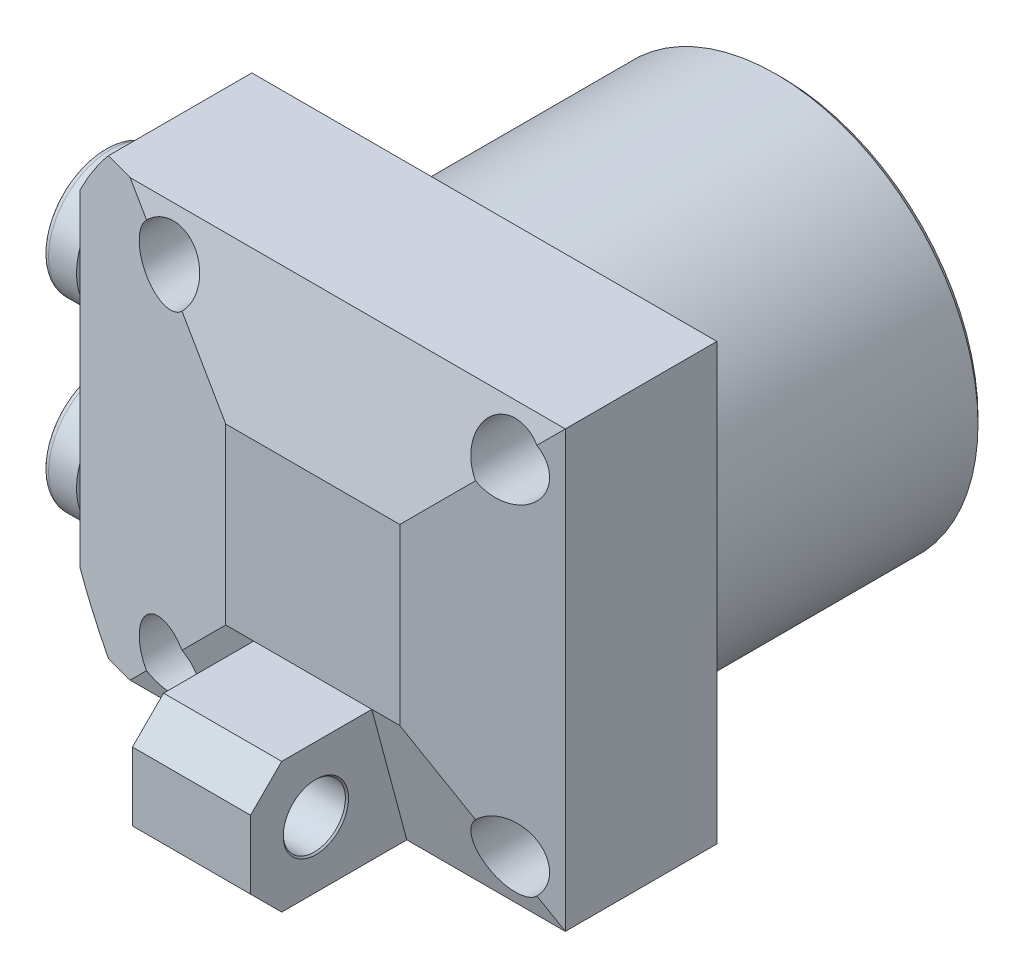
ISO-10303-21;
HEADER;
FILE_DESCRIPTION(('STEP AP214'),'2;1');
FILE_NAME('part.step','',(''),(''),'','','');
FILE_SCHEMA(('AUTOMOTIVE_DESIGN { 1 0 10303 214 1 1 1 1 }'));
ENDSEC;
DATA;
#1=APPLICATION_CONTEXT('core data for automotive mechanical design processes');
#2=APPLICATION_PROTOCOL_DEFINITION('international standard','automotive_design',2000,#1);
#3=PRODUCT_CONTEXT('',#1,'mechanical');
#4=PRODUCT('Part','Part','',(#3));
#5=PRODUCT_RELATED_PRODUCT_CATEGORY('part','',(#4));
#6=PRODUCT_DEFINITION_FORMATION('','',#4);
#7=PRODUCT_DEFINITION_CONTEXT('part definition',#1,'design');
#8=PRODUCT_DEFINITION('design','',#6,#7);
#9=PRODUCT_DEFINITION_SHAPE('','',#8);
#10=(LENGTH_UNIT() NAMED_UNIT(*) SI_UNIT(.MILLI.,.METRE.));
#11=(NAMED_UNIT(*) PLANE_ANGLE_UNIT() SI_UNIT($,.RADIAN.));
#12=(NAMED_UNIT(*) SI_UNIT($,.STERADIAN.) SOLID_ANGLE_UNIT());
#13=UNCERTAINTY_MEASURE_WITH_UNIT(LENGTH_MEASURE(1.E-05),#10,'distance_accuracy_value','');
#14=(GEOMETRIC_REPRESENTATION_CONTEXT(3) GLOBAL_UNCERTAINTY_ASSIGNED_CONTEXT((#13)) GLOBAL_UNIT_ASSIGNED_CONTEXT((#10,
#11,#12)) REPRESENTATION_CONTEXT('',''));
#15=CARTESIAN_POINT('',(0.,0.,0.));
#16=DIRECTION('',(0.,0.,1.));
#17=DIRECTION('',(1.,0.,0.));
#18=AXIS2_PLACEMENT_3D('',#15,#16,#17);
#19=CARTESIAN_POINT('',(-45.5,15.,57.5));
#20=DIRECTION('',(-1.,0.,0.));
#21=DIRECTION('',(0.,-1.,0.));
#22=AXIS2_PLACEMENT_3D('',#19,#20,#21);
#23=PLANE('',#22);
#24=CARTESIAN_POINT('',(-45.5000000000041,15.,57.5));
#25=DIRECTION('',(-1.,0.,0.));
#26=DIRECTION('',(0.,0.,1.));
#27=AXIS2_PLACEMENT_3D('',#24,#25,#26);
#28=CIRCLE('',#27,6.10349999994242);
#29=CARTESIAN_POINT('',(-45.5000000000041,15.,63.6034999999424));
#30=VERTEX_POINT('',#29);
#31=EDGE_CURVE('E1103',#30,#30,#28,.F.);
#32=ORIENTED_EDGE('',*,*,#31,.T.);
#33=EDGE_LOOP('',(#32));
#34=FACE_BOUND('',#33,.T.);
#35=ADVANCED_FACE('F17',(#34),#23,.F.);
#36=CARTESIAN_POINT('',(-45.5,-15.,57.5));
#37=DIRECTION('',(-1.,0.,0.));
#38=DIRECTION('',(0.,-1.,0.));
#39=AXIS2_PLACEMENT_3D('',#36,#37,#38);
#40=PLANE('',#39);
#41=CARTESIAN_POINT('',(-45.5000000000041,-15.,57.5));
#42=DIRECTION('',(-1.,0.,0.));
#43=DIRECTION('',(0.,0.,1.));
#44=AXIS2_PLACEMENT_3D('',#41,#42,#43);
#45=CIRCLE('',#44,6.10349999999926);
#46=CARTESIAN_POINT('',(-45.5000000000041,-15.,63.6034999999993));
#47=VERTEX_POINT('',#46);
#48=EDGE_CURVE('E1001',#47,#47,#45,.F.);
#49=ORIENTED_EDGE('',*,*,#48,.T.);
#50=EDGE_LOOP('',(#49));
#51=FACE_BOUND('',#50,.T.);
#52=ADVANCED_FACE('F1108',(#51),#40,.F.);
#53=CARTESIAN_POINT('',(-46.5,0.,0.));
#54=DIRECTION('',(-1.,0.,0.));
#55=DIRECTION('',(0.,0.,1.));
#56=AXIS2_PLACEMENT_3D('',#53,#54,#55);
#57=PLANE('',#56);
#58=DIRECTION('',(0.,0.5,0.866025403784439));
#59=VECTOR('',#58,1.);
#60=CARTESIAN_POINT('',(-46.5,19.618802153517,57.5));
#61=LINE('',#60,#59);
#62=CARTESIAN_POINT('',(-46.5,19.618802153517,57.5));
#63=VERTEX_POINT('',#62);
#64=CARTESIAN_POINT('',(-46.5,17.3094010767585,53.5));
#65=VERTEX_POINT('',#64);
#66=EDGE_CURVE('E1005',#63,#65,#61,.F.);
#67=ORIENTED_EDGE('',*,*,#66,.T.);
#68=DIRECTION('',(0.,1.,0.));
#69=VECTOR('',#68,1.);
#70=CARTESIAN_POINT('',(-46.5,17.3094010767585,53.5));
#71=LINE('',#70,#69);
#72=CARTESIAN_POINT('',(-46.5,12.6905989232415,53.5));
#73=VERTEX_POINT('',#72);
#74=EDGE_CURVE('E1000',#65,#73,#71,.F.);
#75=ORIENTED_EDGE('',*,*,#74,.T.);
#76=DIRECTION('',(0.,0.5,-0.866025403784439));
#77=VECTOR('',#76,1.);
#78=CARTESIAN_POINT('',(-46.5,12.6905989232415,53.5));
#79=LINE('',#78,#77);
#80=CARTESIAN_POINT('',(-46.5,10.381197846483,57.5));
#81=VERTEX_POINT('',#80);
#82=EDGE_CURVE('E998',#73,#81,#79,.F.);
#83=ORIENTED_EDGE('',*,*,#82,.T.);
#84=DIRECTION('',(0.,-0.5,-0.866025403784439));
#85=VECTOR('',#84,1.);
#86=CARTESIAN_POINT('',(-46.5,10.381197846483,57.5));
#87=LINE('',#86,#85);
#88=CARTESIAN_POINT('',(-46.5,12.6905989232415,61.5));
#89=VERTEX_POINT('',#88);
#90=EDGE_CURVE('E1020',#81,#89,#87,.F.);
#91=ORIENTED_EDGE('',*,*,#90,.T.);
#92=DIRECTION('',(0.,1.,0.));
#93=VECTOR('',#92,1.);
#94=CARTESIAN_POINT('',(-46.5,12.6905989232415,61.5));
#95=LINE('',#94,#93);
#96=CARTESIAN_POINT('',(-46.5,17.3094010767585,61.5));
#97=VERTEX_POINT('',#96);
#98=EDGE_CURVE('E1013',#89,#97,#95,.T.);
#99=ORIENTED_EDGE('',*,*,#98,.T.);
#100=DIRECTION('',(0.,-0.5,0.866025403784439));
#101=VECTOR('',#100,1.);
#102=CARTESIAN_POINT('',(-46.5,17.3094010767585,61.5));
#103=LINE('',#102,#101);
#104=EDGE_CURVE('E1009',#97,#63,#103,.F.);
#105=ORIENTED_EDGE('',*,*,#104,.T.);
#106=EDGE_LOOP('',(#67,#75,#83,#91,#99,#105));
#107=FACE_BOUND('',#106,.T.);
#108=ADVANCED_FACE('F1140',(#107),#57,.T.);
#109=CARTESIAN_POINT('',(-46.5,0.,0.));
#110=DIRECTION('',(-1.,0.,0.));
#111=DIRECTION('',(0.,0.,1.));
#112=AXIS2_PLACEMENT_3D('',#109,#110,#111);
#113=PLANE('',#112);
#114=DIRECTION('',(0.,0.5,0.866025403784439));
#115=VECTOR('',#114,1.);
#116=CARTESIAN_POINT('',(-46.5,-10.381197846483,57.5));
#117=LINE('',#116,#115);
#118=CARTESIAN_POINT('',(-46.5,-10.381197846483,57.5));
#119=VERTEX_POINT('',#118);
#120=CARTESIAN_POINT('',(-46.5,-12.6905989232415,53.5));
#121=VERTEX_POINT('',#120);
#122=EDGE_CURVE('E1030',#119,#121,#117,.F.);
#123=ORIENTED_EDGE('',*,*,#122,.T.);
#124=DIRECTION('',(0.,1.,0.));
#125=VECTOR('',#124,1.);
#126=CARTESIAN_POINT('',(-46.5,-12.6905989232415,53.5));
#127=LINE('',#126,#125);
#128=CARTESIAN_POINT('',(-46.5,-17.3094010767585,53.5));
#129=VERTEX_POINT('',#128);
#130=EDGE_CURVE('E1026',#121,#129,#127,.F.);
#131=ORIENTED_EDGE('',*,*,#130,.T.);
#132=DIRECTION('',(0.,0.500000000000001,-0.866025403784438));
#133=VECTOR('',#132,1.);
#134=CARTESIAN_POINT('',(-46.5,-17.3094010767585,53.5));
#135=LINE('',#134,#133);
#136=CARTESIAN_POINT('',(-46.5,-19.618802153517,57.5));
#137=VERTEX_POINT('',#136);
#138=EDGE_CURVE('E1024',#129,#137,#135,.F.);
#139=ORIENTED_EDGE('',*,*,#138,.T.);
#140=DIRECTION('',(0.,-0.5,-0.866025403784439));
#141=VECTOR('',#140,1.);
#142=CARTESIAN_POINT('',(-46.5,-19.618802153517,57.5));
#143=LINE('',#142,#141);
#144=CARTESIAN_POINT('',(-46.5,-17.3094010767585,61.5));
#145=VERTEX_POINT('',#144);
#146=EDGE_CURVE('E1045',#137,#145,#143,.F.);
#147=ORIENTED_EDGE('',*,*,#146,.T.);
#148=DIRECTION('',(0.,1.,0.));
#149=VECTOR('',#148,1.);
#150=CARTESIAN_POINT('',(-46.5,-17.3094010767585,61.5));
#151=LINE('',#150,#149);
#152=CARTESIAN_POINT('',(-46.5,-12.6905989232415,61.5));
#153=VERTEX_POINT('',#152);
#154=EDGE_CURVE('E1038',#145,#153,#151,.T.);
#155=ORIENTED_EDGE('',*,*,#154,.T.);
#156=DIRECTION('',(0.,-0.5,0.866025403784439));
#157=VECTOR('',#156,1.);
#158=CARTESIAN_POINT('',(-46.5,-12.6905989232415,61.5));
#159=LINE('',#158,#157);
#160=EDGE_CURVE('E1034',#153,#119,#159,.F.);
#161=ORIENTED_EDGE('',*,*,#160,.T.);
#162=EDGE_LOOP('',(#123,#131,#139,#147,#155,#161));
#163=FACE_BOUND('',#162,.T.);
#164=ADVANCED_FACE('F1136',(#163),#113,.T.);
#165=CARTESIAN_POINT('',(-45.4999999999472,15.,57.5));
#166=DIRECTION('',(-1.,0.,0.));
#167=DIRECTION('',(0.,0.,1.));
#168=AXIS2_PLACEMENT_3D('',#165,#166,#167);
#169=CONICAL_SURFACE('',#168,6.10349999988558,0.785398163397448);
#170=CARTESIAN_POINT('',(-45.2965,15.,57.5));
#171=DIRECTION('',(-1.,0.,0.));
#172=DIRECTION('',(0.,0.,1.));
#173=AXIS2_PLACEMENT_3D('',#170,#171,#172);
#174=CIRCLE('',#173,5.89999999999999);
#175=CARTESIAN_POINT('',(-45.2965,15.,63.4));
#176=VERTEX_POINT('',#175);
#177=EDGE_CURVE('E875',#176,#176,#174,.F.);
#178=ORIENTED_EDGE('',*,*,#177,.T.);
#179=EDGE_LOOP('',(#178));
#180=FACE_BOUND('',#179,.T.);
#181=ORIENTED_EDGE('',*,*,#31,.F.);
#182=EDGE_LOOP('',(#181));
#183=FACE_BOUND('',#182,.T.);
#184=ADVANCED_FACE('F868',(#180,#183),#169,.F.);
#185=CARTESIAN_POINT('',(-15.6799999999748,15.,57.5));
#186=DIRECTION('',(-1.,0.,0.));
#187=DIRECTION('',(0.,0.,1.));
#188=AXIS2_PLACEMENT_3D('',#185,#186,#187);
#189=CONICAL_SURFACE('',#188,5.89999999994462,1.02974425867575);
#190=CARTESIAN_POINT('',(-12.1349223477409,15.,57.5));
#191=VERTEX_POINT('',#190);
#192=VERTEX_LOOP('',#191);
#193=FACE_BOUND('',#192,.T.);
#194=CARTESIAN_POINT('',(-15.68,15.,57.5));
#195=DIRECTION('',(-1.,0.,0.));
#196=DIRECTION('',(0.,0.,1.));
#197=AXIS2_PLACEMENT_3D('',#194,#195,#196);
#198=CIRCLE('',#197,5.89999999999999);
#199=CARTESIAN_POINT('',(-15.68,15.,63.4));
#200=VERTEX_POINT('',#199);
#201=EDGE_CURVE('E872',#200,#200,#198,.T.);
#202=ORIENTED_EDGE('',*,*,#201,.T.);
#203=EDGE_LOOP('',(#202));
#204=FACE_BOUND('',#203,.T.);
#205=ADVANCED_FACE('F864',(#193,#204),#189,.F.);
#206=CARTESIAN_POINT('',(-45.5000000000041,-15.,57.5));
#207=DIRECTION('',(-1.,0.,0.));
#208=DIRECTION('',(0.,0.,1.));
#209=AXIS2_PLACEMENT_3D('',#206,#207,#208);
#210=CONICAL_SURFACE('',#209,6.10349999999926,0.785398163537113);
#211=ORIENTED_EDGE('',*,*,#48,.F.);
#212=EDGE_LOOP('',(#211));
#213=FACE_BOUND('',#212,.T.);
#214=CARTESIAN_POINT('',(-45.2965,-15.,57.5));
#215=DIRECTION('',(-1.,0.,0.));
#216=DIRECTION('',(0.,0.,1.));
#217=AXIS2_PLACEMENT_3D('',#214,#215,#216);
#218=CIRCLE('',#217,5.89999999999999);
#219=CARTESIAN_POINT('',(-45.2965,-15.,63.4));
#220=VERTEX_POINT('',#219);
#221=EDGE_CURVE('E874',#220,#220,#218,.F.);
#222=ORIENTED_EDGE('',*,*,#221,.T.);
#223=EDGE_LOOP('',(#222));
#224=FACE_BOUND('',#223,.T.);
#225=ADVANCED_FACE('F867',(#213,#224),#210,.F.);
#226=CARTESIAN_POINT('',(-15.6799999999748,-15.,57.5));
#227=DIRECTION('',(-1.,0.,0.));
#228=DIRECTION('',(0.,0.,1.));
#229=AXIS2_PLACEMENT_3D('',#226,#227,#228);
#230=CONICAL_SURFACE('',#229,5.89999999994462,1.02974425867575);
#231=CARTESIAN_POINT('',(-12.1349223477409,-15.,57.5));
#232=VERTEX_POINT('',#231);
#233=VERTEX_LOOP('',#232);
#234=FACE_BOUND('',#233,.T.);
#235=CARTESIAN_POINT('',(-15.68,-15.,57.5));
#236=DIRECTION('',(-1.,0.,0.));
#237=DIRECTION('',(0.,0.,1.));
#238=AXIS2_PLACEMENT_3D('',#235,#236,#237);
#239=CIRCLE('',#238,5.89999999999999);
#240=CARTESIAN_POINT('',(-15.68,-15.,63.4));
#241=VERTEX_POINT('',#240);
#242=EDGE_CURVE('E878',#241,#241,#239,.T.);
#243=ORIENTED_EDGE('',*,*,#242,.T.);
#244=EDGE_LOOP('',(#243));
#245=FACE_BOUND('',#244,.T.);
#246=ADVANCED_FACE('F1112',(#234,#245),#230,.F.);
#247=CARTESIAN_POINT('',(-46.5,12.6905989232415,53.5));
#248=DIRECTION('',(0.,-0.866025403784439,-0.5));
#249=DIRECTION('',(0.,0.5,-0.866025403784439));
#250=AXIS2_PLACEMENT_3D('',#247,#248,#249);
#251=PLANE('',#250);
#252=DIRECTION('',(1.,0.,0.));
#253=VECTOR('',#252,1.);
#254=CARTESIAN_POINT('',(-46.5,10.381197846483,57.5));
#255=LINE('',#254,#253);
#256=CARTESIAN_POINT('',(-51.5,10.381197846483,57.5));
#257=VERTEX_POINT('',#256);
#258=EDGE_CURVE('E1017',#257,#81,#255,.T.);
#259=ORIENTED_EDGE('',*,*,#258,.T.);
#260=ORIENTED_EDGE('',*,*,#82,.F.);
#261=DIRECTION('',(-1.,0.,0.));
#262=VECTOR('',#261,1.);
#263=CARTESIAN_POINT('',(-46.5,12.6905989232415,53.5));
#264=LINE('',#263,#262);
#265=CARTESIAN_POINT('',(-51.5,12.6905989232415,53.5));
#266=VERTEX_POINT('',#265);
#267=EDGE_CURVE('E1003',#73,#266,#264,.T.);
#268=ORIENTED_EDGE('',*,*,#267,.T.);
#269=DIRECTION('',(0.,0.5,-0.866025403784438));
#270=VECTOR('',#269,1.);
#271=CARTESIAN_POINT('',(-51.5,10.381197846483,57.5));
#272=LINE('',#271,#270);
#273=EDGE_CURVE('E997',#257,#266,#272,.T.);
#274=ORIENTED_EDGE('',*,*,#273,.F.);
#275=EDGE_LOOP('',(#259,#260,#268,#274));
#276=FACE_BOUND('',#275,.T.);
#277=ADVANCED_FACE('F1124',(#276),#251,.F.);
#278=CARTESIAN_POINT('',(-46.5,17.3094010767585,53.5));
#279=DIRECTION('',(0.,0.,-1.));
#280=DIRECTION('',(-1.,0.,0.));
#281=AXIS2_PLACEMENT_3D('',#278,#279,#280);
#282=PLANE('',#281);
#283=ORIENTED_EDGE('',*,*,#267,.F.);
#284=ORIENTED_EDGE('',*,*,#74,.F.);
#285=DIRECTION('',(1.,0.,0.));
#286=VECTOR('',#285,1.);
#287=CARTESIAN_POINT('',(-46.5,17.3094010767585,53.5));
#288=LINE('',#287,#286);
#289=CARTESIAN_POINT('',(-51.5,17.3094010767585,53.5));
#290=VERTEX_POINT('',#289);
#291=EDGE_CURVE('E1007',#65,#290,#288,.F.);
#292=ORIENTED_EDGE('',*,*,#291,.T.);
#293=DIRECTION('',(0.,-1.,0.));
#294=VECTOR('',#293,1.);
#295=CARTESIAN_POINT('',(-51.5,15.,53.5));
#296=LINE('',#295,#294);
#297=EDGE_CURVE('E1061',#266,#290,#296,.F.);
#298=ORIENTED_EDGE('',*,*,#297,.F.);
#299=EDGE_LOOP('',(#283,#284,#292,#298));
#300=FACE_BOUND('',#299,.T.);
#301=ADVANCED_FACE('F1129',(#300),#282,.F.);
#302=CARTESIAN_POINT('',(-46.5,19.618802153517,57.5));
#303=DIRECTION('',(0.,0.866025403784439,-0.5));
#304=DIRECTION('',(0.,0.5,0.866025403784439));
#305=AXIS2_PLACEMENT_3D('',#302,#303,#304);
#306=PLANE('',#305);
#307=ORIENTED_EDGE('',*,*,#291,.F.);
#308=ORIENTED_EDGE('',*,*,#66,.F.);
#309=DIRECTION('',(1.,0.,0.));
#310=VECTOR('',#309,1.);
#311=CARTESIAN_POINT('',(-46.5,19.618802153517,57.5));
#312=LINE('',#311,#310);
#313=CARTESIAN_POINT('',(-51.5,19.618802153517,57.5));
#314=VERTEX_POINT('',#313);
#315=EDGE_CURVE('E1011',#63,#314,#312,.F.);
#316=ORIENTED_EDGE('',*,*,#315,.T.);
#317=DIRECTION('',(0.,0.5,0.866025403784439));
#318=VECTOR('',#317,1.);
#319=CARTESIAN_POINT('',(-51.5,17.3094010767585,53.5));
#320=LINE('',#319,#318);
#321=EDGE_CURVE('E1064',#290,#314,#320,.T.);
#322=ORIENTED_EDGE('',*,*,#321,.F.);
#323=EDGE_LOOP('',(#307,#308,#316,#322));
#324=FACE_BOUND('',#323,.T.);
#325=ADVANCED_FACE('F1216',(#324),#306,.F.);
#326=CARTESIAN_POINT('',(-46.5,17.3094010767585,61.5));
#327=DIRECTION('',(0.,0.866025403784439,0.5));
#328=DIRECTION('',(0.,-0.5,0.866025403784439));
#329=AXIS2_PLACEMENT_3D('',#326,#327,#328);
#330=PLANE('',#329);
#331=ORIENTED_EDGE('',*,*,#315,.F.);
#332=ORIENTED_EDGE('',*,*,#104,.F.);
#333=DIRECTION('',(1.,0.,0.));
#334=VECTOR('',#333,1.);
#335=CARTESIAN_POINT('',(-46.5,17.3094010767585,61.5));
#336=LINE('',#335,#334);
#337=CARTESIAN_POINT('',(-51.5,17.3094010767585,61.5));
#338=VERTEX_POINT('',#337);
#339=EDGE_CURVE('E1015',#97,#338,#336,.F.);
#340=ORIENTED_EDGE('',*,*,#339,.T.);
#341=DIRECTION('',(0.,-0.5,0.866025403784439));
#342=VECTOR('',#341,1.);
#343=CARTESIAN_POINT('',(-51.5,19.618802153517,57.5));
#344=LINE('',#343,#342);
#345=EDGE_CURVE('E1067',#314,#338,#344,.T.);
#346=ORIENTED_EDGE('',*,*,#345,.F.);
#347=EDGE_LOOP('',(#331,#332,#340,#346));
#348=FACE_BOUND('',#347,.T.);
#349=ADVANCED_FACE('F1225',(#348),#330,.F.);
#350=CARTESIAN_POINT('',(-46.5,12.6905989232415,61.5));
#351=DIRECTION('',(0.,0.,1.));
#352=DIRECTION('',(1.,0.,0.));
#353=AXIS2_PLACEMENT_3D('',#350,#351,#352);
#354=PLANE('',#353);
#355=ORIENTED_EDGE('',*,*,#339,.F.);
#356=ORIENTED_EDGE('',*,*,#98,.F.);
#357=DIRECTION('',(1.,0.,0.));
#358=VECTOR('',#357,1.);
#359=CARTESIAN_POINT('',(-46.5,12.6905989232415,61.5));
#360=LINE('',#359,#358);
#361=CARTESIAN_POINT('',(-51.5,12.6905989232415,61.5));
#362=VERTEX_POINT('',#361);
#363=EDGE_CURVE('E1022',#89,#362,#360,.F.);
#364=ORIENTED_EDGE('',*,*,#363,.T.);
#365=DIRECTION('',(0.,-1.,0.));
#366=VECTOR('',#365,1.);
#367=CARTESIAN_POINT('',(-51.5,15.,61.5));
#368=LINE('',#367,#366);
#369=EDGE_CURVE('E1070',#338,#362,#368,.T.);
#370=ORIENTED_EDGE('',*,*,#369,.F.);
#371=EDGE_LOOP('',(#355,#356,#364,#370));
#372=FACE_BOUND('',#371,.T.);
#373=ADVANCED_FACE('F1235',(#372),#354,.F.);
#374=CARTESIAN_POINT('',(-46.5,10.381197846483,57.5));
#375=DIRECTION('',(0.,-0.866025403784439,0.5));
#376=DIRECTION('',(0.,-0.5,-0.866025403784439));
#377=AXIS2_PLACEMENT_3D('',#374,#375,#376);
#378=PLANE('',#377);
#379=ORIENTED_EDGE('',*,*,#363,.F.);
#380=ORIENTED_EDGE('',*,*,#90,.F.);
#381=ORIENTED_EDGE('',*,*,#258,.F.);
#382=DIRECTION('',(0.,-0.5,-0.866025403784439));
#383=VECTOR('',#382,1.);
#384=CARTESIAN_POINT('',(-51.5,12.6905989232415,61.5));
#385=LINE('',#384,#383);
#386=EDGE_CURVE('E1073',#362,#257,#385,.T.);
#387=ORIENTED_EDGE('',*,*,#386,.F.);
#388=EDGE_LOOP('',(#379,#380,#381,#387));
#389=FACE_BOUND('',#388,.T.);
#390=ADVANCED_FACE('F1245',(#389),#378,.F.);
#391=CARTESIAN_POINT('',(-46.5,-17.3094010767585,53.5));
#392=DIRECTION('',(0.,-0.866025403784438,-0.500000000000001));
#393=DIRECTION('',(0.,0.500000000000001,-0.866025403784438));
#394=AXIS2_PLACEMENT_3D('',#391,#392,#393);
#395=PLANE('',#394);
#396=DIRECTION('',(1.,0.,0.));
#397=VECTOR('',#396,1.);
#398=CARTESIAN_POINT('',(-46.5,-19.618802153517,57.5));
#399=LINE('',#398,#397);
#400=CARTESIAN_POINT('',(-51.5,-19.618802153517,57.5));
#401=VERTEX_POINT('',#400);
#402=EDGE_CURVE('E1042',#401,#137,#399,.T.);
#403=ORIENTED_EDGE('',*,*,#402,.T.);
#404=ORIENTED_EDGE('',*,*,#138,.F.);
#405=DIRECTION('',(-1.,0.,0.));
#406=VECTOR('',#405,1.);
#407=CARTESIAN_POINT('',(-46.5,-17.3094010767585,53.5));
#408=LINE('',#407,#406);
#409=CARTESIAN_POINT('',(-51.5,-17.3094010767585,53.5));
#410=VERTEX_POINT('',#409);
#411=EDGE_CURVE('E1028',#129,#410,#408,.T.);
#412=ORIENTED_EDGE('',*,*,#411,.T.);
#413=DIRECTION('',(0.,0.5,-0.866025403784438));
#414=VECTOR('',#413,1.);
#415=CARTESIAN_POINT('',(-51.5,-19.618802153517,57.5));
#416=LINE('',#415,#414);
#417=EDGE_CURVE('E276',#401,#410,#416,.T.);
#418=ORIENTED_EDGE('',*,*,#417,.F.);
#419=EDGE_LOOP('',(#403,#404,#412,#418));
#420=FACE_BOUND('',#419,.T.);
#421=ADVANCED_FACE('F1255',(#420),#395,.F.);
#422=CARTESIAN_POINT('',(-46.5,-12.6905989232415,53.5));
#423=DIRECTION('',(0.,0.,-1.));
#424=DIRECTION('',(-1.,0.,0.));
#425=AXIS2_PLACEMENT_3D('',#422,#423,#424);
#426=PLANE('',#425);
#427=ORIENTED_EDGE('',*,*,#411,.F.);
#428=ORIENTED_EDGE('',*,*,#130,.F.);
#429=DIRECTION('',(1.,0.,0.));
#430=VECTOR('',#429,1.);
#431=CARTESIAN_POINT('',(-46.5,-12.6905989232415,53.5));
#432=LINE('',#431,#430);
#433=CARTESIAN_POINT('',(-51.5,-12.6905989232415,53.5));
#434=VERTEX_POINT('',#433);
#435=EDGE_CURVE('E1032',#121,#434,#432,.F.);
#436=ORIENTED_EDGE('',*,*,#435,.T.);
#437=DIRECTION('',(0.,-1.,0.));
#438=VECTOR('',#437,1.);
#439=CARTESIAN_POINT('',(-51.5,-15.,53.5));
#440=LINE('',#439,#438);
#441=EDGE_CURVE('E1679',#410,#434,#440,.F.);
#442=ORIENTED_EDGE('',*,*,#441,.F.);
#443=EDGE_LOOP('',(#427,#428,#436,#442));
#444=FACE_BOUND('',#443,.T.);
#445=ADVANCED_FACE('F1265',(#444),#426,.F.);
#446=CARTESIAN_POINT('',(-46.5,-10.381197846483,57.5));
#447=DIRECTION('',(0.,0.866025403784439,-0.5));
#448=DIRECTION('',(0.,0.5,0.866025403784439));
#449=AXIS2_PLACEMENT_3D('',#446,#447,#448);
#450=PLANE('',#449);
#451=ORIENTED_EDGE('',*,*,#435,.F.);
#452=ORIENTED_EDGE('',*,*,#122,.F.);
#453=DIRECTION('',(1.,0.,0.));
#454=VECTOR('',#453,1.);
#455=CARTESIAN_POINT('',(-46.5,-10.381197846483,57.5));
#456=LINE('',#455,#454);
#457=CARTESIAN_POINT('',(-51.5,-10.381197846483,57.5));
#458=VERTEX_POINT('',#457);
#459=EDGE_CURVE('E1036',#119,#458,#456,.F.);
#460=ORIENTED_EDGE('',*,*,#459,.T.);
#461=DIRECTION('',(0.,0.5,0.866025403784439));
#462=VECTOR('',#461,1.);
#463=CARTESIAN_POINT('',(-51.5,-12.6905989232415,53.5));
#464=LINE('',#463,#462);
#465=EDGE_CURVE('E1677',#434,#458,#464,.T.);
#466=ORIENTED_EDGE('',*,*,#465,.F.);
#467=EDGE_LOOP('',(#451,#452,#460,#466));
#468=FACE_BOUND('',#467,.T.);
#469=ADVANCED_FACE('F1275',(#468),#450,.F.);
#470=CARTESIAN_POINT('',(-46.5,-12.6905989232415,61.5));
#471=DIRECTION('',(0.,0.866025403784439,0.5));
#472=DIRECTION('',(0.,-0.5,0.866025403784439));
#473=AXIS2_PLACEMENT_3D('',#470,#471,#472);
#474=PLANE('',#473);
#475=ORIENTED_EDGE('',*,*,#459,.F.);
#476=ORIENTED_EDGE('',*,*,#160,.F.);
#477=DIRECTION('',(1.,0.,0.));
#478=VECTOR('',#477,1.);
#479=CARTESIAN_POINT('',(-46.5,-12.6905989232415,61.5));
#480=LINE('',#479,#478);
#481=CARTESIAN_POINT('',(-51.5,-12.6905989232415,61.5));
#482=VERTEX_POINT('',#481);
#483=EDGE_CURVE('E1040',#153,#482,#480,.F.);
#484=ORIENTED_EDGE('',*,*,#483,.T.);
#485=DIRECTION('',(0.,-0.5,0.866025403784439));
#486=VECTOR('',#485,1.);
#487=CARTESIAN_POINT('',(-51.5,-10.381197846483,57.5));
#488=LINE('',#487,#486);
#489=EDGE_CURVE('E1672',#458,#482,#488,.T.);
#490=ORIENTED_EDGE('',*,*,#489,.F.);
#491=EDGE_LOOP('',(#475,#476,#484,#490));
#492=FACE_BOUND('',#491,.T.);
#493=ADVANCED_FACE('F1285',(#492),#474,.F.);
#494=CARTESIAN_POINT('',(-46.5,-17.3094010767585,61.5));
#495=DIRECTION('',(0.,0.,1.));
#496=DIRECTION('',(1.,0.,0.));
#497=AXIS2_PLACEMENT_3D('',#494,#495,#496);
#498=PLANE('',#497);
#499=ORIENTED_EDGE('',*,*,#483,.F.);
#500=ORIENTED_EDGE('',*,*,#154,.F.);
#501=DIRECTION('',(1.,0.,0.));
#502=VECTOR('',#501,1.);
#503=CARTESIAN_POINT('',(-46.5,-17.3094010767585,61.5));
#504=LINE('',#503,#502);
#505=CARTESIAN_POINT('',(-51.5,-17.3094010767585,61.5));
#506=VERTEX_POINT('',#505);
#507=EDGE_CURVE('E881',#145,#506,#504,.F.);
#508=ORIENTED_EDGE('',*,*,#507,.T.);
#509=DIRECTION('',(0.,-1.,0.));
#510=VECTOR('',#509,1.);
#511=CARTESIAN_POINT('',(-51.5,-15.,61.5));
#512=LINE('',#511,#510);
#513=EDGE_CURVE('E1668',#482,#506,#512,.T.);
#514=ORIENTED_EDGE('',*,*,#513,.F.);
#515=EDGE_LOOP('',(#499,#500,#508,#514));
#516=FACE_BOUND('',#515,.T.);
#517=ADVANCED_FACE('F1295',(#516),#498,.F.);
#518=CARTESIAN_POINT('',(-46.5,-19.618802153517,57.5));
#519=DIRECTION('',(0.,-0.866025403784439,0.5));
#520=DIRECTION('',(0.,-0.5,-0.866025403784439));
#521=AXIS2_PLACEMENT_3D('',#518,#519,#520);
#522=PLANE('',#521);
#523=ORIENTED_EDGE('',*,*,#507,.F.);
#524=ORIENTED_EDGE('',*,*,#146,.F.);
#525=ORIENTED_EDGE('',*,*,#402,.F.);
#526=DIRECTION('',(0.,-0.5,-0.866025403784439));
#527=VECTOR('',#526,1.);
#528=CARTESIAN_POINT('',(-51.5,-17.3094010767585,61.5));
#529=LINE('',#528,#527);
#530=EDGE_CURVE('E1666',#506,#401,#529,.T.);
#531=ORIENTED_EDGE('',*,*,#530,.F.);
#532=EDGE_LOOP('',(#523,#524,#525,#531));
#533=FACE_BOUND('',#532,.T.);
#534=ADVANCED_FACE('F1305',(#533),#522,.F.);
#535=CARTESIAN_POINT('',(-46.,15.,57.5));
#536=DIRECTION('',(-1.,0.,0.));
#537=DIRECTION('',(0.,0.,1.));
#538=AXIS2_PLACEMENT_3D('',#535,#536,#537);
#539=CYLINDRICAL_SURFACE('',#538,5.89999999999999);
#540=ORIENTED_EDGE('',*,*,#177,.F.);
#541=EDGE_LOOP('',(#540));
#542=FACE_BOUND('',#541,.T.);
#543=ORIENTED_EDGE('',*,*,#201,.F.);
#544=EDGE_LOOP('',(#543));
#545=FACE_BOUND('',#544,.T.);
#546=CARTESIAN_POINT('',(-38.4030344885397,15.,51.6));
#547=CARTESIAN_POINT('',(-38.4030278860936,15.0703627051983,51.6000018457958));
#548=CARTESIAN_POINT('',(-38.3965368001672,15.1407662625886,51.6012746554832));
#549=CARTESIAN_POINT('',(-38.3711030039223,15.2792129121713,51.6062015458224));
#550=CARTESIAN_POINT('',(-38.3521472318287,15.3472534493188,51.6098581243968));
#551=CARTESIAN_POINT('',(-38.3033651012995,15.4786209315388,51.6190785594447));
#552=CARTESIAN_POINT('',(-38.2736093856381,15.5419753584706,51.6246300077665));
#553=CARTESIAN_POINT('',(-38.2049459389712,15.6633289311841,51.6370889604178));
#554=CARTESIAN_POINT('',(-38.1660329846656,15.7213249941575,51.6439972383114));
#555=CARTESIAN_POINT('',(-38.0648382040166,15.8518787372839,51.6613261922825));
#556=CARTESIAN_POINT('',(-37.9992483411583,15.9218263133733,51.6720974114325));
#557=CARTESIAN_POINT('',(-37.857572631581,16.0500690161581,51.6938306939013));
#558=CARTESIAN_POINT('',(-37.781471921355,16.1083473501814,51.7047930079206));
#559=CARTESIAN_POINT('',(-37.6201884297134,16.2139946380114,51.7259923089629));
#560=CARTESIAN_POINT('',(-37.5348777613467,16.2611701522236,51.7362145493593));
#561=CARTESIAN_POINT('',(-37.3583921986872,16.3432438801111,51.7547877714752));
#562=CARTESIAN_POINT('',(-37.2672170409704,16.3781415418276,51.7631386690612));
#563=CARTESIAN_POINT('',(-37.0632129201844,16.4406914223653,51.7784924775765));
#564=CARTESIAN_POINT('',(-36.9495345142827,16.4657497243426,51.7849471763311));
#565=CARTESIAN_POINT('',(-36.719331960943,16.4968732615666,51.7930186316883));
#566=CARTESIAN_POINT('',(-36.6028064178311,16.5029289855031,51.7946329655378));
#567=CARTESIAN_POINT('',(-36.3718110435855,16.494482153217,51.7924127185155));
#568=CARTESIAN_POINT('',(-36.2573330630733,16.4802177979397,51.7886412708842));
#569=CARTESIAN_POINT('',(-36.0335023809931,16.4301005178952,51.7758855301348));
#570=CARTESIAN_POINT('',(-35.9241428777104,16.3942771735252,51.7669083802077));
#571=CARTESIAN_POINT('',(-35.7301805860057,16.3071249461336,51.746469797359));
#572=CARTESIAN_POINT('',(-35.6442477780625,16.2586354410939,51.7355255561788));
#573=CARTESIAN_POINT('',(-35.4835381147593,16.1460566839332,51.7120956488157));
#574=CARTESIAN_POINT('',(-35.4087511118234,16.0819817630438,51.6996114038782));
#575=CARTESIAN_POINT('',(-35.2818466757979,15.948867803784,51.6764593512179));
#576=CARTESIAN_POINT('',(-35.2280728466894,15.8814062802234,51.6657568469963));
#577=CARTESIAN_POINT('',(-35.1332519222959,15.7378054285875,51.6458663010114));
#578=CARTESIAN_POINT('',(-35.0922079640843,15.6616639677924,51.6366786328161));
#579=CARTESIAN_POINT('',(-35.0258407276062,15.5070658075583,51.6213417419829));
#580=CARTESIAN_POINT('',(-34.9998385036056,15.4289114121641,51.6150643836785));
#581=CARTESIAN_POINT('',(-34.9612226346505,15.2693276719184,51.6056121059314));
#582=CARTESIAN_POINT('',(-34.9485752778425,15.1879071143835,51.6024293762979));
#583=CARTESIAN_POINT('',(-34.9401924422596,15.070778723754,51.6003171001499));
#584=CARTESIAN_POINT('',(-34.9389299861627,15.0353995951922,51.5999982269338));
#585=CARTESIAN_POINT('',(-34.9389394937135,14.9188302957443,51.6000040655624));
#586=CARTESIAN_POINT('',(-34.9455988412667,14.8375529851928,51.6016939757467));
#587=CARTESIAN_POINT('',(-34.9721237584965,14.6771747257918,51.6082885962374));
#588=CARTESIAN_POINT('',(-34.9920208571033,14.5980794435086,51.6132009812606));
#589=CARTESIAN_POINT('',(-35.0445184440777,14.444531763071,51.6257018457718));
#590=CARTESIAN_POINT('',(-35.0771049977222,14.3700743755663,51.6332873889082));
#591=CARTESIAN_POINT('',(-35.1541006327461,14.2278465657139,51.6503064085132));
#592=CARTESIAN_POINT('',(-35.1985026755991,14.1600721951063,51.6597387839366));
#593=CARTESIAN_POINT('',(-35.2981399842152,14.0326325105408,51.6794857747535));
#594=CARTESIAN_POINT('',(-35.353427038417,13.9730083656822,51.6898044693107));
#595=CARTESIAN_POINT('',(-35.4730755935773,13.8636560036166,51.7101964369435));
#596=CARTESIAN_POINT('',(-35.5374384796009,13.8139292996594,51.7202696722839));
#597=CARTESIAN_POINT('',(-35.6753272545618,13.7239731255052,51.7394496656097));
#598=CARTESIAN_POINT('',(-35.7490650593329,13.6840616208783,51.7485198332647));
#599=CARTESIAN_POINT('',(-35.9019896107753,13.6160299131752,51.7645095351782));
#600=CARTESIAN_POINT('',(-35.9811779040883,13.5879130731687,51.7714284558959));
#601=CARTESIAN_POINT('',(-36.1491614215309,13.5416298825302,51.7830274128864));
#602=CARTESIAN_POINT('',(-36.2382268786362,13.5243963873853,51.7874940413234));
#603=CARTESIAN_POINT('',(-36.4179877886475,13.502874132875,51.7930979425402));
#604=CARTESIAN_POINT('',(-36.5086839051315,13.4985907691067,51.7942338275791));
#605=CARTESIAN_POINT('',(-36.7014537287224,13.5024474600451,51.7932191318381));
#606=CARTESIAN_POINT('',(-36.8034911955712,13.5122554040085,51.7906272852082));
#607=CARTESIAN_POINT('',(-37.004997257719,13.5463845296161,51.7818445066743));
#608=CARTESIAN_POINT('',(-37.1044632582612,13.5707198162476,51.7756500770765));
#609=CARTESIAN_POINT('',(-37.3111613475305,13.637162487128,51.7594426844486));
#610=CARTESIAN_POINT('',(-37.4177664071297,13.6811403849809,51.7490435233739));
#611=CARTESIAN_POINT('',(-37.6220164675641,13.7861169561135,51.7259742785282));
#612=CARTESIAN_POINT('',(-37.7196656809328,13.8471075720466,51.7133052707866));
#613=CARTESIAN_POINT('',(-37.8819069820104,13.9705859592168,51.6902389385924));
#614=CARTESIAN_POINT('',(-37.9490356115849,14.0297645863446,51.67995827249));
#615=CARTESIAN_POINT('',(-38.0729466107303,14.1582178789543,51.6599991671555));
#616=CARTESIAN_POINT('',(-38.1297439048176,14.2274777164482,51.6503198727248));
#617=CARTESIAN_POINT('',(-38.2199390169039,14.360794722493,51.6344233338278));
#618=CARTESIAN_POINT('',(-38.2557425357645,14.4231834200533,51.6278997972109));
#619=CARTESIAN_POINT('',(-38.3167078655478,14.5530895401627,51.6165915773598));
#620=CARTESIAN_POINT('',(-38.3418873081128,14.620598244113,51.6118040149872));
#621=CARTESIAN_POINT('',(-38.374733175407,14.7402637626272,51.6055030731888));
#622=CARTESIAN_POINT('',(-38.3852994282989,14.7916064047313,51.603453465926));
#623=CARTESIAN_POINT('',(-38.3994527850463,14.8952917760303,51.6007011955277));
#624=CARTESIAN_POINT('',(-38.4030394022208,14.9476345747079,51.5999986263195));
#625=CARTESIAN_POINT('',(-38.4030344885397,15.,51.6));
#626=B_SPLINE_CURVE_WITH_KNOTS('',3,(#546,#547,#548,#549,#550,#551,#552,#553,#554,#555,#556,
#557,#558,#559,#560,#561,#562,#563,#564,#565,#566,#567,#568,#569,#570,#571,#572,#573,#574,#575,
#576,#577,#578,#579,#580,#581,#582,#583,#584,#585,#586,#587,#588,#589,#590,#591,#592,#593,#594,
#595,#596,#597,#598,#599,#600,#601,#602,#603,#604,#605,#606,#607,#608,#609,#610,#611,#612,#613,
#614,#615,#616,#617,#618,#619,#620,#621,#622,#623,#624,#625),.UNSPECIFIED.,.T.,.F.,(4,2,2,2,2,2,
2,2,2,2,2,2,2,2,2,2,2,2,2,2,2,2,2,2,2,2,2,2,2,2,2,2,2,2,2,2,2,2,2,4),(0.,0.21086319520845,
0.421947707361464,0.631675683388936,0.841523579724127,1.12944442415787,1.41777667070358,
1.71081172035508,2.00385994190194,2.35197749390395,2.7002692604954,3.04451163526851,
3.38828275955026,3.68437821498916,3.98020242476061,4.23967539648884,4.49921226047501,
4.74587220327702,4.99190799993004,5.09806249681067,5.34147005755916,5.58545943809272,
5.82918163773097,6.07275897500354,6.31752449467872,6.56232740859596,6.8142439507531,
7.06623227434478,7.33762304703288,7.60912687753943,7.9155340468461,8.22223920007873,
8.56805381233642,8.91370492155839,9.18297405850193,9.45185106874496,9.6676925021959,
9.88317430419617,10.0400922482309,10.1970211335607),.UNSPECIFIED.);
#627=CARTESIAN_POINT('',(-38.4030344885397,15.,51.6));
#628=VERTEX_POINT('',#627);
#629=EDGE_CURVE('E192',#628,#628,#626,.T.);
#630=ORIENTED_EDGE('',*,*,#629,.T.);
#631=EDGE_LOOP('',(#630));
#632=FACE_BOUND('',#631,.T.);
#633=ADVANCED_FACE('F1118',(#542,#545,#632),#539,.F.);
#634=CARTESIAN_POINT('',(-46.,-15.,57.5));
#635=DIRECTION('',(-1.,0.,0.));
#636=DIRECTION('',(0.,0.,1.));
#637=AXIS2_PLACEMENT_3D('',#634,#635,#636);
#638=CYLINDRICAL_SURFACE('',#637,5.89999999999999);
#639=ORIENTED_EDGE('',*,*,#221,.F.);
#640=EDGE_LOOP('',(#639));
#641=FACE_BOUND('',#640,.T.);
#642=CARTESIAN_POINT('',(-34.9389328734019,-15.,51.6));
#643=CARTESIAN_POINT('',(-34.9389394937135,-15.0811697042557,51.6000040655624));
#644=CARTESIAN_POINT('',(-34.9455988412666,-15.1624470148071,51.6016939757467));
#645=CARTESIAN_POINT('',(-34.9721237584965,-15.3228252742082,51.6082885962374));
#646=CARTESIAN_POINT('',(-34.9920208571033,-15.4019205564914,51.6132009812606));
#647=CARTESIAN_POINT('',(-35.0445184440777,-15.555468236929,51.6257018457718));
#648=CARTESIAN_POINT('',(-35.0771049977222,-15.6299256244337,51.6332873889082));
#649=CARTESIAN_POINT('',(-35.154100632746,-15.772153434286,51.6503064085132));
#650=CARTESIAN_POINT('',(-35.1985026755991,-15.8399278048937,51.6597387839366));
#651=CARTESIAN_POINT('',(-35.2981399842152,-15.9673674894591,51.6794857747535));
#652=CARTESIAN_POINT('',(-35.353427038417,-16.0269916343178,51.6898044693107));
#653=CARTESIAN_POINT('',(-35.4730755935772,-16.1363439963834,51.7101964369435));
#654=CARTESIAN_POINT('',(-35.5374384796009,-16.1860707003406,51.7202696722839));
#655=CARTESIAN_POINT('',(-35.6753272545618,-16.2760268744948,51.7394496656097));
#656=CARTESIAN_POINT('',(-35.7490650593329,-16.3159383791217,51.7485198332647));
#657=CARTESIAN_POINT('',(-35.9019896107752,-16.3839700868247,51.7645095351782));
#658=CARTESIAN_POINT('',(-35.9811779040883,-16.4120869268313,51.7714284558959));
#659=CARTESIAN_POINT('',(-36.1491614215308,-16.4583701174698,51.7830274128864));
#660=CARTESIAN_POINT('',(-36.2382268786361,-16.4756036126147,51.7874940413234));
#661=CARTESIAN_POINT('',(-36.4179877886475,-16.497125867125,51.7930979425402));
#662=CARTESIAN_POINT('',(-36.5086839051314,-16.5014092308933,51.7942338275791));
#663=CARTESIAN_POINT('',(-36.7014537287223,-16.4975525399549,51.7932191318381));
#664=CARTESIAN_POINT('',(-36.8034911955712,-16.4877445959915,51.7906272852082));
#665=CARTESIAN_POINT('',(-37.004997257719,-16.4536154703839,51.7818445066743));
#666=CARTESIAN_POINT('',(-37.1044632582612,-16.4292801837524,51.7756500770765));
#667=CARTESIAN_POINT('',(-37.3111613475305,-16.362837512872,51.7594426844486));
#668=CARTESIAN_POINT('',(-37.4177664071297,-16.3188596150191,51.7490435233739));
#669=CARTESIAN_POINT('',(-37.622016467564,-16.2138830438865,51.7259742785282));
#670=CARTESIAN_POINT('',(-37.7196656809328,-16.1528924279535,51.7133052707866));
#671=CARTESIAN_POINT('',(-37.8819069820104,-16.0294140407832,51.6902389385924));
#672=CARTESIAN_POINT('',(-37.9490356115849,-15.9702354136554,51.67995827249));
#673=CARTESIAN_POINT('',(-38.0729466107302,-15.8417821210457,51.6599991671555));
#674=CARTESIAN_POINT('',(-38.1297439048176,-15.7725222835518,51.6503198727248));
#675=CARTESIAN_POINT('',(-38.2199390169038,-15.639205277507,51.6344233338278));
#676=CARTESIAN_POINT('',(-38.2557425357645,-15.5768165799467,51.6278997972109));
#677=CARTESIAN_POINT('',(-38.3167078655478,-15.4469104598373,51.6165915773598));
#678=CARTESIAN_POINT('',(-38.3418873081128,-15.379401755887,51.6118040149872));
#679=CARTESIAN_POINT('',(-38.374733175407,-15.2597362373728,51.6055030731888));
#680=CARTESIAN_POINT('',(-38.3852994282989,-15.2083935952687,51.603453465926));
#681=CARTESIAN_POINT('',(-38.3994527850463,-15.1047082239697,51.6007011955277));
#682=CARTESIAN_POINT('',(-38.4030394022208,-15.0523654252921,51.5999986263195));
#683=CARTESIAN_POINT('',(-38.4030278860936,-14.9296372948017,51.6000018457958));
#684=CARTESIAN_POINT('',(-38.3965368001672,-14.8592337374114,51.6012746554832));
#685=CARTESIAN_POINT('',(-38.3711030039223,-14.7207870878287,51.6062015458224));
#686=CARTESIAN_POINT('',(-38.3521472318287,-14.6527465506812,51.6098581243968));
#687=CARTESIAN_POINT('',(-38.3033651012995,-14.5213790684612,51.6190785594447));
#688=CARTESIAN_POINT('',(-38.2736093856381,-14.4580246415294,51.6246300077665));
#689=CARTESIAN_POINT('',(-38.2049459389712,-14.3366710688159,51.6370889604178));
#690=CARTESIAN_POINT('',(-38.1660329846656,-14.2786750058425,51.6439972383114));
#691=CARTESIAN_POINT('',(-38.0648382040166,-14.1481212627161,51.6613261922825));
#692=CARTESIAN_POINT('',(-37.9992483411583,-14.0781736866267,51.6720974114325));
#693=CARTESIAN_POINT('',(-37.857572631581,-13.9499309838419,51.6938306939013));
#694=CARTESIAN_POINT('',(-37.781471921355,-13.8916526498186,51.7047930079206));
#695=CARTESIAN_POINT('',(-37.6201884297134,-13.7860053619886,51.7259923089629));
#696=CARTESIAN_POINT('',(-37.5348777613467,-13.7388298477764,51.7362145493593));
#697=CARTESIAN_POINT('',(-37.3583921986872,-13.6567561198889,51.7547877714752));
#698=CARTESIAN_POINT('',(-37.2672170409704,-13.6218584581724,51.7631386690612));
#699=CARTESIAN_POINT('',(-37.0632129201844,-13.5593085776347,51.7784924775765));
#700=CARTESIAN_POINT('',(-36.9495345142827,-13.5342502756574,51.7849471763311));
#701=CARTESIAN_POINT('',(-36.719331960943,-13.5031267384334,51.7930186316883));
#702=CARTESIAN_POINT('',(-36.6028064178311,-13.4970710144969,51.7946329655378));
#703=CARTESIAN_POINT('',(-36.3718110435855,-13.505517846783,51.7924127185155));
#704=CARTESIAN_POINT('',(-36.2573330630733,-13.5197822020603,51.7886412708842));
#705=CARTESIAN_POINT('',(-36.0335023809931,-13.5698994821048,51.7758855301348));
#706=CARTESIAN_POINT('',(-35.9241428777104,-13.6057228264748,51.7669083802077));
#707=CARTESIAN_POINT('',(-35.7301805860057,-13.6928750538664,51.746469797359));
#708=CARTESIAN_POINT('',(-35.6442477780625,-13.7413645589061,51.7355255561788));
#709=CARTESIAN_POINT('',(-35.4835381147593,-13.8539433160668,51.7120956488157));
#710=CARTESIAN_POINT('',(-35.4087511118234,-13.9180182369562,51.6996114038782));
#711=CARTESIAN_POINT('',(-35.2818466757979,-14.051132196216,51.6764593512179));
#712=CARTESIAN_POINT('',(-35.2280728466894,-14.1185937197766,51.6657568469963));
#713=CARTESIAN_POINT('',(-35.1332519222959,-14.2621945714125,51.6458663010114));
#714=CARTESIAN_POINT('',(-35.0922079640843,-14.3383360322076,51.6366786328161));
#715=CARTESIAN_POINT('',(-35.0258407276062,-14.4929341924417,51.6213417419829));
#716=CARTESIAN_POINT('',(-34.9998385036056,-14.5710885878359,51.6150643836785));
#717=CARTESIAN_POINT('',(-34.9612226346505,-14.7306723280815,51.6056121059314));
#718=CARTESIAN_POINT('',(-34.9485752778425,-14.8120928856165,51.6024293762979));
#719=CARTESIAN_POINT('',(-34.9401924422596,-14.929221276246,51.6003171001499));
#720=CARTESIAN_POINT('',(-34.9389299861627,-14.9646004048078,51.5999982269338));
#721=CARTESIAN_POINT('',(-34.9389328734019,-15.,51.6));
#722=B_SPLINE_CURVE_WITH_KNOTS('',3,(#642,#643,#644,#645,#646,#647,#648,#649,#650,#651,#652,
#653,#654,#655,#656,#657,#658,#659,#660,#661,#662,#663,#664,#665,#666,#667,#668,#669,#670,#671,
#672,#673,#674,#675,#676,#677,#678,#679,#680,#681,#682,#683,#684,#685,#686,#687,#688,#689,#690,
#691,#692,#693,#694,#695,#696,#697,#698,#699,#700,#701,#702,#703,#704,#705,#706,#707,#708,#709,
#710,#711,#712,#713,#714,#715,#716,#717,#718,#719,#720,#721),.UNSPECIFIED.,.T.,.F.,(4,2,2,2,2,2,
2,2,2,2,2,2,2,2,2,2,2,2,2,2,2,2,2,2,2,2,2,2,2,2,2,2,2,2,2,2,2,2,2,4),(0.,0.243407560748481,
0.487396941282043,0.7311191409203,0.974696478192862,1.21946199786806,1.46426491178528,
1.71618145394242,1.9681697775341,2.23956055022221,2.51106438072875,2.81747155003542,
3.12417670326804,3.46999131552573,3.8156424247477,4.08491156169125,4.3537885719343,
4.56963000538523,4.7851118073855,4.94202975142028,5.09895863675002,5.30982183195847,
5.52090634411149,5.73063432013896,5.94048221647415,6.22840306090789,6.5167353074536,
6.8097703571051,7.10281857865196,7.45093613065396,7.79922789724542,8.14347027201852,
8.48724139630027,8.78333685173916,9.07916106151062,9.33863403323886,9.59817089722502,
9.84483084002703,10.0908666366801,10.1970211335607),.UNSPECIFIED.);
#723=CARTESIAN_POINT('',(-34.9389328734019,-15.,51.6));
#724=VERTEX_POINT('',#723);
#725=EDGE_CURVE('E184',#724,#724,#722,.T.);
#726=ORIENTED_EDGE('',*,*,#725,.T.);
#727=EDGE_LOOP('',(#726));
#728=FACE_BOUND('',#727,.T.);
#729=ORIENTED_EDGE('',*,*,#242,.F.);
#730=EDGE_LOOP('',(#729));
#731=FACE_BOUND('',#730,.T.);
#732=ADVANCED_FACE('F198',(#641,#728,#731),#638,.F.);
#733=CARTESIAN_POINT('',(-51.5,15.,57.5));
#734=DIRECTION('',(-1.,0.,0.));
#735=DIRECTION('',(0.,-1.,0.));
#736=AXIS2_PLACEMENT_3D('',#733,#734,#735);
#737=PLANE('',#736);
#738=CARTESIAN_POINT('',(-51.5,15.,57.5));
#739=DIRECTION('',(1.,0.,0.));
#740=DIRECTION('',(0.,1.,0.));
#741=AXIS2_PLACEMENT_3D('',#738,#739,#740);
#742=CIRCLE('',#741,8.99999999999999);
#743=CARTESIAN_POINT('',(-51.5,24.,57.5));
#744=VERTEX_POINT('',#743);
#745=CARTESIAN_POINT('',(-51.5,5.99999999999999,57.5));
#746=VERTEX_POINT('',#745);
#747=EDGE_CURVE('E269',#744,#746,#742,.T.);
#748=ORIENTED_EDGE('',*,*,#747,.F.);
#749=CARTESIAN_POINT('',(-51.5,15.,57.5));
#750=DIRECTION('',(1.,0.,0.));
#751=DIRECTION('',(0.,-1.,0.));
#752=AXIS2_PLACEMENT_3D('',#749,#750,#751);
#753=CIRCLE('',#752,8.99999999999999);
#754=EDGE_CURVE('E191',#746,#744,#753,.T.);
#755=ORIENTED_EDGE('',*,*,#754,.F.);
#756=EDGE_LOOP('',(#748,#755));
#757=FACE_BOUND('',#756,.T.);
#758=ORIENTED_EDGE('',*,*,#369,.T.);
#759=ORIENTED_EDGE('',*,*,#386,.T.);
#760=ORIENTED_EDGE('',*,*,#273,.T.);
#761=ORIENTED_EDGE('',*,*,#297,.T.);
#762=ORIENTED_EDGE('',*,*,#321,.T.);
#763=ORIENTED_EDGE('',*,*,#345,.T.);
#764=EDGE_LOOP('',(#758,#759,#760,#761,#762,#763));
#765=FACE_BOUND('',#764,.T.);
#766=ADVANCED_FACE('F237',(#757,#765),#737,.T.);
#767=CARTESIAN_POINT('',(-51.5,-15.,57.5));
#768=DIRECTION('',(-1.,0.,0.));
#769=DIRECTION('',(0.,-1.,0.));
#770=AXIS2_PLACEMENT_3D('',#767,#768,#769);
#771=PLANE('',#770);
#772=CARTESIAN_POINT('',(-51.5,-15.,57.5));
#773=DIRECTION('',(1.,0.,0.));
#774=DIRECTION('',(0.,1.,0.));
#775=AXIS2_PLACEMENT_3D('',#772,#773,#774);
#776=CIRCLE('',#775,8.99999999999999);
#777=CARTESIAN_POINT('',(-51.5,-6.00000000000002,57.5));
#778=VERTEX_POINT('',#777);
#779=CARTESIAN_POINT('',(-51.5,-24.,57.5));
#780=VERTEX_POINT('',#779);
#781=EDGE_CURVE('E264',#778,#780,#776,.T.);
#782=ORIENTED_EDGE('',*,*,#781,.F.);
#783=CARTESIAN_POINT('',(-51.5,-15.,57.5));
#784=DIRECTION('',(1.,0.,0.));
#785=DIRECTION('',(0.,-1.,0.));
#786=AXIS2_PLACEMENT_3D('',#783,#784,#785);
#787=CIRCLE('',#786,8.99999999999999);
#788=EDGE_CURVE('E260',#780,#778,#787,.T.);
#789=ORIENTED_EDGE('',*,*,#788,.F.);
#790=EDGE_LOOP('',(#782,#789));
#791=FACE_BOUND('',#790,.T.);
#792=ORIENTED_EDGE('',*,*,#513,.T.);
#793=ORIENTED_EDGE('',*,*,#530,.T.);
#794=ORIENTED_EDGE('',*,*,#417,.T.);
#795=ORIENTED_EDGE('',*,*,#441,.T.);
#796=ORIENTED_EDGE('',*,*,#465,.T.);
#797=ORIENTED_EDGE('',*,*,#489,.T.);
#798=EDGE_LOOP('',(#792,#793,#794,#795,#796,#797));
#799=FACE_BOUND('',#798,.T.);
#800=ADVANCED_FACE('F233',(#791,#799),#771,.T.);
#801=CARTESIAN_POINT('',(-9.5,-24.5,84.5));
#802=DIRECTION('',(-1.,0.,0.));
#803=DIRECTION('',(0.,0.,1.));
#804=AXIS2_PLACEMENT_3D('',#801,#802,#803);
#805=CYLINDRICAL_SURFACE('',#804,4.99999999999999);
#806=CARTESIAN_POINT('',(9.25000000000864,-24.5,84.5));
#807=DIRECTION('',(1.,0.,0.));
#808=DIRECTION('',(0.,0.,-1.));
#809=AXIS2_PLACEMENT_3D('',#806,#807,#808);
#810=CIRCLE('',#809,5.00000000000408);
#811=CARTESIAN_POINT('',(9.25000000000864,-24.5,79.4999999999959));
#812=VERTEX_POINT('',#811);
#813=EDGE_CURVE('E273',#812,#812,#810,.T.);
#814=ORIENTED_EDGE('',*,*,#813,.T.);
#815=EDGE_LOOP('',(#814));
#816=FACE_BOUND('',#815,.T.);
#817=CARTESIAN_POINT('',(-9.25000000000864,-24.5,84.5));
#818=DIRECTION('',(-1.,0.,0.));
#819=DIRECTION('',(0.,0.,1.));
#820=AXIS2_PLACEMENT_3D('',#817,#818,#819);
#821=CIRCLE('',#820,4.99999999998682);
#822=CARTESIAN_POINT('',(-9.25000000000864,-24.5,89.4999999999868));
#823=VERTEX_POINT('',#822);
#824=EDGE_CURVE('E306',#823,#823,#821,.T.);
#825=ORIENTED_EDGE('',*,*,#824,.T.);
#826=EDGE_LOOP('',(#825));
#827=FACE_BOUND('',#826,.T.);
#828=ADVANCED_FACE('F229',(#816,#827),#805,.F.);
#829=CARTESIAN_POINT('',(-21.9999999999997,27.5000000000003,61.));
#830=DIRECTION('',(0.,0.,-1.));
#831=DIRECTION('',(-1.,0.,0.));
#832=AXIS2_PLACEMENT_3D('',#829,#830,#831);
#833=PLANE('',#832);
#834=CARTESIAN_POINT('',(-27.4999999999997,27.5000000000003,61.));
#835=DIRECTION('',(0.,0.,1.));
#836=DIRECTION('',(1.,0.,0.));
#837=AXIS2_PLACEMENT_3D('',#834,#835,#836);
#838=CIRCLE('',#837,5.49999999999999);
#839=CARTESIAN_POINT('',(-21.9999999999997,27.5000000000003,61.));
#840=VERTEX_POINT('',#839);
#841=EDGE_CURVE('E174',#840,#840,#838,.T.);
#842=ORIENTED_EDGE('',*,*,#841,.T.);
#843=EDGE_LOOP('',(#842));
#844=FACE_BOUND('',#843,.T.);
#845=CARTESIAN_POINT('',(-27.4999999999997,27.5000000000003,61.));
#846=DIRECTION('',(0.,0.,1.));
#847=DIRECTION('',(1.,0.,0.));
#848=AXIS2_PLACEMENT_3D('',#845,#846,#847);
#849=CIRCLE('',#848,3.4);
#850=CARTESIAN_POINT('',(-24.0999999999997,27.5000000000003,61.));
#851=VERTEX_POINT('',#850);
#852=EDGE_CURVE('E167',#851,#851,#849,.F.);
#853=ORIENTED_EDGE('',*,*,#852,.T.);
#854=EDGE_LOOP('',(#853));
#855=FACE_BOUND('',#854,.T.);
#856=ADVANCED_FACE('F225',(#844,#855),#833,.F.);
#857=CARTESIAN_POINT('',(-22.,-27.5,61.));
#858=DIRECTION('',(0.,0.,-1.));
#859=DIRECTION('',(-1.,0.,0.));
#860=AXIS2_PLACEMENT_3D('',#857,#858,#859);
#861=PLANE('',#860);
#862=CARTESIAN_POINT('',(-27.5,-27.5,61.));
#863=DIRECTION('',(0.,0.,1.));
#864=DIRECTION('',(1.,0.,0.));
#865=AXIS2_PLACEMENT_3D('',#862,#863,#864);
#866=CIRCLE('',#865,5.5);
#867=CARTESIAN_POINT('',(-22.,-27.5,61.));
#868=VERTEX_POINT('',#867);
#869=EDGE_CURVE('E170',#868,#868,#866,.T.);
#870=ORIENTED_EDGE('',*,*,#869,.T.);
#871=EDGE_LOOP('',(#870));
#872=FACE_BOUND('',#871,.T.);
#873=CARTESIAN_POINT('',(-27.5,-27.5,61.));
#874=DIRECTION('',(0.,0.,1.));
#875=DIRECTION('',(1.,0.,0.));
#876=AXIS2_PLACEMENT_3D('',#873,#874,#875);
#877=CIRCLE('',#876,3.39999999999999);
#878=CARTESIAN_POINT('',(-24.1,-27.5,61.));
#879=VERTEX_POINT('',#878);
#880=EDGE_CURVE('E164',#879,#879,#877,.F.);
#881=ORIENTED_EDGE('',*,*,#880,.T.);
#882=EDGE_LOOP('',(#881));
#883=FACE_BOUND('',#882,.T.);
#884=ADVANCED_FACE('F221',(#872,#883),#861,.F.);
#885=CARTESIAN_POINT('',(32.9999999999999,-27.5000000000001,61.));
#886=DIRECTION('',(0.,0.,-1.));
#887=DIRECTION('',(-1.,0.,0.));
#888=AXIS2_PLACEMENT_3D('',#885,#886,#887);
#889=PLANE('',#888);
#890=CARTESIAN_POINT('',(27.4999999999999,-27.5000000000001,61.));
#891=DIRECTION('',(0.,0.,1.));
#892=DIRECTION('',(1.,0.,0.));
#893=AXIS2_PLACEMENT_3D('',#890,#891,#892);
#894=CIRCLE('',#893,5.5);
#895=CARTESIAN_POINT('',(32.9999999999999,-27.5000000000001,61.));
#896=VERTEX_POINT('',#895);
#897=EDGE_CURVE('E180',#896,#896,#894,.T.);
#898=ORIENTED_EDGE('',*,*,#897,.T.);
#899=EDGE_LOOP('',(#898));
#900=FACE_BOUND('',#899,.T.);
#901=CARTESIAN_POINT('',(27.4999999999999,-27.5000000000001,61.));
#902=DIRECTION('',(0.,0.,1.));
#903=DIRECTION('',(1.,0.,0.));
#904=AXIS2_PLACEMENT_3D('',#901,#902,#903);
#905=CIRCLE('',#904,3.39999999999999);
#906=CARTESIAN_POINT('',(30.8999999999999,-27.5000000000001,61.));
#907=VERTEX_POINT('',#906);
#908=EDGE_CURVE('E161',#907,#907,#905,.F.);
#909=ORIENTED_EDGE('',*,*,#908,.T.);
#910=EDGE_LOOP('',(#909));
#911=FACE_BOUND('',#910,.T.);
#912=ADVANCED_FACE('F217',(#900,#911),#889,.F.);
#913=CARTESIAN_POINT('',(33.,27.5,61.));
#914=DIRECTION('',(0.,0.,-1.));
#915=DIRECTION('',(-1.,0.,0.));
#916=AXIS2_PLACEMENT_3D('',#913,#914,#915);
#917=PLANE('',#916);
#918=CARTESIAN_POINT('',(27.5,27.5,61.));
#919=DIRECTION('',(0.,0.,1.));
#920=DIRECTION('',(1.,0.,0.));
#921=AXIS2_PLACEMENT_3D('',#918,#919,#920);
#922=CIRCLE('',#921,5.5);
#923=CARTESIAN_POINT('',(33.,27.5,61.));
#924=VERTEX_POINT('',#923);
#925=EDGE_CURVE('E177',#924,#924,#922,.T.);
#926=ORIENTED_EDGE('',*,*,#925,.T.);
#927=EDGE_LOOP('',(#926));
#928=FACE_BOUND('',#927,.T.);
#929=CARTESIAN_POINT('',(27.5,27.5,61.));
#930=DIRECTION('',(0.,0.,1.));
#931=DIRECTION('',(1.,0.,0.));
#932=AXIS2_PLACEMENT_3D('',#929,#930,#931);
#933=CIRCLE('',#932,3.39999999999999);
#934=CARTESIAN_POINT('',(30.9,27.5,61.));
#935=VERTEX_POINT('',#934);
#936=EDGE_CURVE('E158',#935,#935,#933,.F.);
#937=ORIENTED_EDGE('',*,*,#936,.T.);
#938=EDGE_LOOP('',(#937));
#939=FACE_BOUND('',#938,.T.);
#940=ADVANCED_FACE('F213',(#928,#939),#917,.F.);
#941=CARTESIAN_POINT('',(-35.,15.,54.4942286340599));
#942=DIRECTION('',(-0.500000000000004,0.,-0.866025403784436));
#943=DIRECTION('',(-0.866025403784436,0.,0.500000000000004));
#944=AXIS2_PLACEMENT_3D('',#941,#942,#943);
#945=CYLINDRICAL_SURFACE('',#944,1.5);
#946=ORIENTED_EDGE('',*,*,#629,.F.);
#947=EDGE_LOOP('',(#946));
#948=FACE_BOUND('',#947,.T.);
#949=CARTESIAN_POINT('',(-39.5,15.,46.7));
#950=DIRECTION('',(0.,0.,-1.));
#951=DIRECTION('',(-1.,0.,0.));
#952=AXIS2_PLACEMENT_3D('',#949,#950,#951);
#953=ELLIPSE('',#952,1.73205080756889,1.5);
#954=CARTESIAN_POINT('',(-41.2320508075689,15.,46.7));
#955=VERTEX_POINT('',#954);
#956=EDGE_CURVE('E155',#955,#955,#953,.F.);
#957=ORIENTED_EDGE('',*,*,#956,.F.);
#958=EDGE_LOOP('',(#957));
#959=FACE_BOUND('',#958,.T.);
#960=ADVANCED_FACE('F205',(#948,#959),#945,.F.);
#961=CARTESIAN_POINT('',(-35.,-15.,54.4942286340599));
#962=DIRECTION('',(-0.500000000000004,0.,-0.866025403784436));
#963=DIRECTION('',(-0.866025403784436,0.,0.500000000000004));
#964=AXIS2_PLACEMENT_3D('',#961,#962,#963);
#965=CYLINDRICAL_SURFACE('',#964,1.5);
#966=CARTESIAN_POINT('',(-39.5,-15.,46.7));
#967=DIRECTION('',(0.,0.,-1.));
#968=DIRECTION('',(-1.,0.,0.));
#969=AXIS2_PLACEMENT_3D('',#966,#967,#968);
#970=ELLIPSE('',#969,1.73205080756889,1.5);
#971=CARTESIAN_POINT('',(-41.2320508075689,-15.,46.7));
#972=VERTEX_POINT('',#971);
#973=EDGE_CURVE('E148',#972,#972,#970,.F.);
#974=ORIENTED_EDGE('',*,*,#973,.F.);
#975=EDGE_LOOP('',(#974));
#976=FACE_BOUND('',#975,.T.);
#977=ORIENTED_EDGE('',*,*,#725,.F.);
#978=EDGE_LOOP('',(#977));
#979=FACE_BOUND('',#978,.T.);
#980=ADVANCED_FACE('F201',(#976,#979),#965,.F.);
#981=CARTESIAN_POINT('',(-50.5,15.,57.5));
#982=DIRECTION('',(-1.,0.,0.));
#983=DIRECTION('',(0.,-1.,0.));
#984=AXIS2_PLACEMENT_3D('',#981,#982,#983);
#985=TOROIDAL_SURFACE('',#984,8.99999999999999,1.);
#986=ORIENTED_EDGE('',*,*,#754,.T.);
#987=ORIENTED_EDGE('',*,*,#747,.T.);
#988=EDGE_LOOP('',(#986,#987));
#989=FACE_BOUND('',#988,.T.);
#990=CARTESIAN_POINT('',(-50.5,15.,57.5));
#991=DIRECTION('',(1.,0.,0.));
#992=DIRECTION('',(0.,1.,0.));
#993=AXIS2_PLACEMENT_3D('',#990,#991,#992);
#994=CIRCLE('',#993,9.99999999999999);
#995=CARTESIAN_POINT('',(-50.5,25.,57.5));
#996=VERTEX_POINT('',#995);
#997=EDGE_CURVE('E142',#996,#996,#994,.T.);
#998=ORIENTED_EDGE('',*,*,#997,.F.);
#999=EDGE_LOOP('',(#998));
#1000=FACE_BOUND('',#999,.T.);
#1001=ADVANCED_FACE('F204',(#989,#1000),#985,.T.);
#1002=CARTESIAN_POINT('',(-50.5,-15.,57.5));
#1003=DIRECTION('',(-1.,0.,0.));
#1004=DIRECTION('',(0.,-1.,0.));
#1005=AXIS2_PLACEMENT_3D('',#1002,#1003,#1004);
#1006=TOROIDAL_SURFACE('',#1005,8.99999999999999,1.);
#1007=ORIENTED_EDGE('',*,*,#788,.T.);
#1008=ORIENTED_EDGE('',*,*,#781,.T.);
#1009=EDGE_LOOP('',(#1007,#1008));
#1010=FACE_BOUND('',#1009,.T.);
#1011=CARTESIAN_POINT('',(-50.5,-15.,57.5));
#1012=DIRECTION('',(1.,0.,0.));
#1013=DIRECTION('',(0.,1.,0.));
#1014=AXIS2_PLACEMENT_3D('',#1011,#1012,#1013);
#1015=CIRCLE('',#1014,9.99999999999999);
#1016=CARTESIAN_POINT('',(-50.5,-5.00000000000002,57.5));
#1017=VERTEX_POINT('',#1016);
#1018=EDGE_CURVE('E141',#1017,#1017,#1015,.T.);
#1019=ORIENTED_EDGE('',*,*,#1018,.F.);
#1020=EDGE_LOOP('',(#1019));
#1021=FACE_BOUND('',#1020,.T.);
#1022=ADVANCED_FACE('F271',(#1010,#1021),#1006,.T.);
#1023=CARTESIAN_POINT('',(9.50000000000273,-24.5,84.5));
#1024=DIRECTION('',(1.,0.,0.));
#1025=DIRECTION('',(0.,0.,-1.));
#1026=AXIS2_PLACEMENT_3D('',#1023,#1024,#1025);
#1027=CONICAL_SURFACE('',#1026,5.24999999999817,0.785398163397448);
#1028=CARTESIAN_POINT('',(9.50000000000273,-24.5,84.5));
#1029=DIRECTION('',(1.,0.,0.));
#1030=DIRECTION('',(0.,0.,-1.));
#1031=AXIS2_PLACEMENT_3D('',#1028,#1029,#1030);
#1032=CIRCLE('',#1031,5.24999999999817);
#1033=CARTESIAN_POINT('',(9.50000000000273,-24.5,79.2500000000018));
#1034=VERTEX_POINT('',#1033);
#1035=EDGE_CURVE('E627',#1034,#1034,#1032,.T.);
#1036=ORIENTED_EDGE('',*,*,#1035,.T.);
#1037=EDGE_LOOP('',(#1036));
#1038=FACE_BOUND('',#1037,.T.);
#1039=ORIENTED_EDGE('',*,*,#813,.F.);
#1040=EDGE_LOOP('',(#1039));
#1041=FACE_BOUND('',#1040,.T.);
#1042=ADVANCED_FACE('F292',(#1038,#1041),#1027,.F.);
#1043=CARTESIAN_POINT('',(-9.50000000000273,-24.5,84.5));
#1044=DIRECTION('',(-1.,0.,0.));
#1045=DIRECTION('',(0.,0.,1.));
#1046=AXIS2_PLACEMENT_3D('',#1043,#1044,#1045);
#1047=CONICAL_SURFACE('',#1046,5.24999999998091,0.785398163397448);
#1048=ORIENTED_EDGE('',*,*,#824,.F.);
#1049=EDGE_LOOP('',(#1048));
#1050=FACE_BOUND('',#1049,.T.);
#1051=CARTESIAN_POINT('',(-9.50000000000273,-24.5,84.5));
#1052=DIRECTION('',(-1.,0.,0.));
#1053=DIRECTION('',(0.,0.,1.));
#1054=AXIS2_PLACEMENT_3D('',#1051,#1052,#1053);
#1055=CIRCLE('',#1054,5.24999999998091);
#1056=CARTESIAN_POINT('',(-9.50000000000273,-24.5,89.7499999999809));
#1057=VERTEX_POINT('',#1056);
#1058=EDGE_CURVE('E567',#1057,#1057,#1055,.T.);
#1059=ORIENTED_EDGE('',*,*,#1058,.T.);
#1060=EDGE_LOOP('',(#1059));
#1061=FACE_BOUND('',#1060,.T.);
#1062=ADVANCED_FACE('F314',(#1050,#1061),#1047,.F.);
#1063=CARTESIAN_POINT('',(-9.5,-14.,95.));
#1064=DIRECTION('',(0.,-1.,0.));
#1065=DIRECTION('',(0.,0.,-1.));
#1066=AXIS2_PLACEMENT_3D('',#1063,#1064,#1065);
#1067=PLANE('',#1066);
#1068=DIRECTION('',(1.,0.,0.));
#1069=VECTOR('',#1068,1.);
#1070=CARTESIAN_POINT('',(0.,-14.,90.));
#1071=LINE('',#1070,#1069);
#1072=CARTESIAN_POINT('',(9.5,-14.,90.));
#1073=VERTEX_POINT('',#1072);
#1074=CARTESIAN_POINT('',(-9.5,-14.,90.));
#1075=VERTEX_POINT('',#1074);
#1076=EDGE_CURVE('E308',#1073,#1075,#1071,.F.);
#1077=ORIENTED_EDGE('',*,*,#1076,.F.);
#1078=DIRECTION('',(0.,0.,1.));
#1079=VECTOR('',#1078,1.);
#1080=CARTESIAN_POINT('',(9.5,-14.,95.));
#1081=LINE('',#1080,#1079);
#1082=CARTESIAN_POINT('',(9.50000000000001,-14.,75.5));
#1083=VERTEX_POINT('',#1082);
#1084=EDGE_CURVE('E495',#1073,#1083,#1081,.F.);
#1085=ORIENTED_EDGE('',*,*,#1084,.T.);
#1086=DIRECTION('',(1.,0.,0.));
#1087=VECTOR('',#1086,1.);
#1088=CARTESIAN_POINT('',(0.,-14.,75.5));
#1089=LINE('',#1088,#1087);
#1090=CARTESIAN_POINT('',(-9.5,-14.,75.5));
#1091=VERTEX_POINT('',#1090);
#1092=EDGE_CURVE('E173',#1091,#1083,#1089,.T.);
#1093=ORIENTED_EDGE('',*,*,#1092,.F.);
#1094=DIRECTION('',(0.,0.,1.));
#1095=VECTOR('',#1094,1.);
#1096=CARTESIAN_POINT('',(-9.5,-14.,95.));
#1097=LINE('',#1096,#1095);
#1098=EDGE_CURVE('E303',#1091,#1075,#1097,.T.);
#1099=ORIENTED_EDGE('',*,*,#1098,.T.);
#1100=EDGE_LOOP('',(#1077,#1085,#1093,#1099));
#1101=FACE_BOUND('',#1100,.T.);
#1102=ADVANCED_FACE('F320',(#1101),#1067,.F.);
#1103=CARTESIAN_POINT('',(0.,-19.,95.));
#1104=DIRECTION('',(0.,0.707106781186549,0.707106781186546));
#1105=DIRECTION('',(0.,-0.707106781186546,0.707106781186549));
#1106=AXIS2_PLACEMENT_3D('',#1103,#1104,#1105);
#1107=PLANE('',#1106);
#1108=DIRECTION('',(0.,-0.707106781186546,0.707106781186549));
#1109=VECTOR('',#1108,1.);
#1110=CARTESIAN_POINT('',(-9.5,-14.,90.));
#1111=LINE('',#1110,#1109);
#1112=CARTESIAN_POINT('',(-9.5,-19.,95.));
#1113=VERTEX_POINT('',#1112);
#1114=EDGE_CURVE('E299',#1075,#1113,#1111,.T.);
#1115=ORIENTED_EDGE('',*,*,#1114,.T.);
#1116=DIRECTION('',(1.,0.,0.));
#1117=VECTOR('',#1116,1.);
#1118=CARTESIAN_POINT('',(0.,-19.,95.));
#1119=LINE('',#1118,#1117);
#1120=CARTESIAN_POINT('',(9.5,-19.,95.));
#1121=VERTEX_POINT('',#1120);
#1122=EDGE_CURVE('E183',#1121,#1113,#1119,.F.);
#1123=ORIENTED_EDGE('',*,*,#1122,.F.);
#1124=DIRECTION('',(0.,0.707106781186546,-0.707106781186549));
#1125=VECTOR('',#1124,1.);
#1126=CARTESIAN_POINT('',(9.5,-19.,95.));
#1127=LINE('',#1126,#1125);
#1128=EDGE_CURVE('E505',#1121,#1073,#1127,.T.);
#1129=ORIENTED_EDGE('',*,*,#1128,.T.);
#1130=ORIENTED_EDGE('',*,*,#1076,.T.);
#1131=EDGE_LOOP('',(#1115,#1123,#1129,#1130));
#1132=FACE_BOUND('',#1131,.T.);
#1133=ADVANCED_FACE('F477',(#1132),#1107,.T.);
#1134=CARTESIAN_POINT('',(0.,0.,95.));
#1135=DIRECTION('',(0.,0.,1.));
#1136=DIRECTION('',(1.,0.,0.));
#1137=AXIS2_PLACEMENT_3D('',#1134,#1135,#1136);
#1138=PLANE('',#1137);
#1139=DIRECTION('',(0.,1.,0.));
#1140=VECTOR('',#1139,1.);
#1141=CARTESIAN_POINT('',(-9.5,-14.,95.));
#1142=LINE('',#1141,#1140);
#1143=CARTESIAN_POINT('',(-9.5,-30.,95.));
#1144=VERTEX_POINT('',#1143);
#1145=EDGE_CURVE('E302',#1113,#1144,#1142,.F.);
#1146=ORIENTED_EDGE('',*,*,#1145,.T.);
#1147=DIRECTION('',(1.,0.,0.));
#1148=VECTOR('',#1147,1.);
#1149=CARTESIAN_POINT('',(0.,-30.,95.));
#1150=LINE('',#1149,#1148);
#1151=CARTESIAN_POINT('',(9.50000000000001,-30.,95.));
#1152=VERTEX_POINT('',#1151);
#1153=EDGE_CURVE('E626',#1152,#1144,#1150,.F.);
#1154=ORIENTED_EDGE('',*,*,#1153,.F.);
#1155=DIRECTION('',(0.,-1.,0.));
#1156=VECTOR('',#1155,1.);
#1157=CARTESIAN_POINT('',(9.5,-14.,95.));
#1158=LINE('',#1157,#1156);
#1159=EDGE_CURVE('E509',#1152,#1121,#1158,.F.);
#1160=ORIENTED_EDGE('',*,*,#1159,.T.);
#1161=ORIENTED_EDGE('',*,*,#1122,.T.);
#1162=EDGE_LOOP('',(#1146,#1154,#1160,#1161));
#1163=FACE_BOUND('',#1162,.T.);
#1164=ADVANCED_FACE('F473',(#1163),#1138,.T.);
#1165=CARTESIAN_POINT('',(27.4999999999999,-27.5000000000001,75.5));
#1166=DIRECTION('',(0.,0.,1.));
#1167=DIRECTION('',(1.,0.,0.));
#1168=AXIS2_PLACEMENT_3D('',#1165,#1166,#1167);
#1169=CYLINDRICAL_SURFACE('',#1168,5.5);
#1170=ORIENTED_EDGE('',*,*,#897,.F.);
#1171=EDGE_LOOP('',(#1170));
#1172=FACE_BOUND('',#1171,.T.);
#1173=CARTESIAN_POINT('',(27.4999999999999,-27.5000000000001,71.8826859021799));
#1174=DIRECTION('',(0.,0.258819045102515,-0.96592582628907));
#1175=DIRECTION('',(0.,0.96592582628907,0.258819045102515));
#1176=AXIS2_PLACEMENT_3D('',#1173,#1174,#1175);
#1177=ELLIPSE('',#1176,5.69401899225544,5.5);
#1178=CARTESIAN_POINT('',(23.610912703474,-23.610912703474,72.9247637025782));
#1179=VERTEX_POINT('',#1178);
#1180=CARTESIAN_POINT('',(31.389087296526,-31.389087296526,70.8406081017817));
#1181=VERTEX_POINT('',#1180);
#1182=EDGE_CURVE('E516',#1179,#1181,#1177,.F.);
#1183=ORIENTED_EDGE('',*,*,#1182,.T.);
#1184=CARTESIAN_POINT('',(27.4999999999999,-27.5000000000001,71.88268590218));
#1185=DIRECTION('',(-0.258819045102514,0.,-0.96592582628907));
#1186=DIRECTION('',(-0.96592582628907,0.,0.258819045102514));
#1187=AXIS2_PLACEMENT_3D('',#1184,#1185,#1186);
#1188=ELLIPSE('',#1187,5.69401899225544,5.5);
#1189=EDGE_CURVE('E685',#1181,#1179,#1188,.F.);
#1190=ORIENTED_EDGE('',*,*,#1189,.T.);
#1191=EDGE_LOOP('',(#1183,#1190));
#1192=FACE_BOUND('',#1191,.T.);
#1193=ADVANCED_FACE('F469',(#1172,#1192),#1169,.F.);
#1194=CARTESIAN_POINT('',(27.5,27.5,75.5));
#1195=DIRECTION('',(0.,0.,1.));
#1196=DIRECTION('',(1.,0.,0.));
#1197=AXIS2_PLACEMENT_3D('',#1194,#1195,#1196);
#1198=CYLINDRICAL_SURFACE('',#1197,5.5);
#1199=CARTESIAN_POINT('',(27.5,27.5,71.8826859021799));
#1200=DIRECTION('',(0.,-0.258819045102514,-0.96592582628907));
#1201=DIRECTION('',(0.,-0.96592582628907,0.258819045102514));
#1202=AXIS2_PLACEMENT_3D('',#1199,#1200,#1201);
#1203=ELLIPSE('',#1202,5.69401899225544,5.5);
#1204=CARTESIAN_POINT('',(31.389087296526,31.389087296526,70.8406081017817));
#1205=VERTEX_POINT('',#1204);
#1206=CARTESIAN_POINT('',(23.610912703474,23.610912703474,72.9247637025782));
#1207=VERTEX_POINT('',#1206);
#1208=EDGE_CURVE('E670',#1205,#1207,#1203,.F.);
#1209=ORIENTED_EDGE('',*,*,#1208,.T.);
#1210=CARTESIAN_POINT('',(27.5,27.5,71.8826859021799));
#1211=DIRECTION('',(-0.258819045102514,0.,-0.96592582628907));
#1212=DIRECTION('',(-0.96592582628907,0.,0.258819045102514));
#1213=AXIS2_PLACEMENT_3D('',#1210,#1211,#1212);
#1214=ELLIPSE('',#1213,5.69401899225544,5.5);
#1215=EDGE_CURVE('E545',#1207,#1205,#1214,.F.);
#1216=ORIENTED_EDGE('',*,*,#1215,.T.);
#1217=EDGE_LOOP('',(#1209,#1216));
#1218=FACE_BOUND('',#1217,.T.);
#1219=ORIENTED_EDGE('',*,*,#925,.F.);
#1220=EDGE_LOOP('',(#1219));
#1221=FACE_BOUND('',#1220,.T.);
#1222=ADVANCED_FACE('F465',(#1218,#1221),#1198,.F.);
#1223=CARTESIAN_POINT('',(-46.,35.001,66.9256258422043));
#1224=DIRECTION('',(-1.,0.,0.));
#1225=DIRECTION('',(0.,0.,1.));
#1226=AXIS2_PLACEMENT_3D('',#1223,#1224,#1225);
#1227=PLANE('',#1226);
#1228=CARTESIAN_POINT('',(-46.,-15.,57.5));
#1229=DIRECTION('',(1.,0.,0.));
#1230=DIRECTION('',(0.,1.,0.));
#1231=AXIS2_PLACEMENT_3D('',#1228,#1229,#1230);
#1232=CIRCLE('',#1231,9.99999999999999);
#1233=CARTESIAN_POINT('',(-46.,-18.3402960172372,66.9256258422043));
#1234=VERTEX_POINT('',#1233);
#1235=CARTESIAN_POINT('',(-46.,-11.6597039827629,66.9256258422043));
#1236=VERTEX_POINT('',#1235);
#1237=EDGE_CURVE('E145',#1234,#1236,#1232,.F.);
#1238=ORIENTED_EDGE('',*,*,#1237,.F.);
#1239=DIRECTION('',(0.,1.,0.));
#1240=VECTOR('',#1239,1.);
#1241=CARTESIAN_POINT('',(-46.,35.001,66.9256258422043));
#1242=LINE('',#1241,#1240);
#1243=EDGE_CURVE('E131',#1234,#1236,#1242,.T.);
#1244=ORIENTED_EDGE('',*,*,#1243,.T.);
#1245=EDGE_LOOP('',(#1238,#1244));
#1246=FACE_BOUND('',#1245,.T.);
#1247=ADVANCED_FACE('F462',(#1246),#1227,.F.);
#1248=CARTESIAN_POINT('',(-46.,35.001,66.9256258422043));
#1249=DIRECTION('',(-1.,0.,0.));
#1250=DIRECTION('',(0.,0.,1.));
#1251=AXIS2_PLACEMENT_3D('',#1248,#1249,#1250);
#1252=PLANE('',#1251);
#1253=CARTESIAN_POINT('',(-46.,15.,57.5));
#1254=DIRECTION('',(1.,0.,0.));
#1255=DIRECTION('',(0.,1.,0.));
#1256=AXIS2_PLACEMENT_3D('',#1253,#1254,#1255);
#1257=CIRCLE('',#1256,9.99999999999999);
#1258=CARTESIAN_POINT('',(-46.,11.6597039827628,66.9256258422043));
#1259=VERTEX_POINT('',#1258);
#1260=CARTESIAN_POINT('',(-46.,18.3402960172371,66.9256258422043));
#1261=VERTEX_POINT('',#1260);
#1262=EDGE_CURVE('E110',#1259,#1261,#1257,.F.);
#1263=ORIENTED_EDGE('',*,*,#1262,.F.);
#1264=DIRECTION('',(0.,1.,0.));
#1265=VECTOR('',#1264,1.);
#1266=CARTESIAN_POINT('',(-46.,35.001,66.9256258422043));
#1267=LINE('',#1266,#1265);
#1268=EDGE_CURVE('E127',#1259,#1261,#1267,.T.);
#1269=ORIENTED_EDGE('',*,*,#1268,.T.);
#1270=EDGE_LOOP('',(#1263,#1269));
#1271=FACE_BOUND('',#1270,.T.);
#1272=ADVANCED_FACE('F128',(#1271),#1252,.F.);
#1273=CARTESIAN_POINT('',(-27.4999999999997,27.5000000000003,75.5));
#1274=DIRECTION('',(0.,0.,1.));
#1275=DIRECTION('',(1.,0.,0.));
#1276=AXIS2_PLACEMENT_3D('',#1273,#1274,#1275);
#1277=CYLINDRICAL_SURFACE('',#1276,5.49999999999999);
#1278=CARTESIAN_POINT('',(-27.4999999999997,27.5000000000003,71.88268590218));
#1279=DIRECTION('',(0.258819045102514,0.,-0.96592582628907));
#1280=DIRECTION('',(0.96592582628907,0.,0.258819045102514));
#1281=AXIS2_PLACEMENT_3D('',#1278,#1279,#1280);
#1282=ELLIPSE('',#1281,5.69401899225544,5.49999999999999);
#1283=CARTESIAN_POINT('',(-31.389087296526,31.389087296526,70.8406081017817));
#1284=VERTEX_POINT('',#1283);
#1285=CARTESIAN_POINT('',(-23.610912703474,23.610912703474,72.9247637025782));
#1286=VERTEX_POINT('',#1285);
#1287=EDGE_CURVE('E656',#1284,#1286,#1282,.F.);
#1288=ORIENTED_EDGE('',*,*,#1287,.T.);
#1289=CARTESIAN_POINT('',(-27.4999999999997,27.5000000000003,71.8826859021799));
#1290=DIRECTION('',(0.,-0.258819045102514,-0.96592582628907));
#1291=DIRECTION('',(0.,-0.96592582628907,0.258819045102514));
#1292=AXIS2_PLACEMENT_3D('',#1289,#1290,#1291);
#1293=ELLIPSE('',#1292,5.69401899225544,5.49999999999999);
#1294=EDGE_CURVE('E581',#1286,#1284,#1293,.F.);
#1295=ORIENTED_EDGE('',*,*,#1294,.T.);
#1296=EDGE_LOOP('',(#1288,#1295));
#1297=FACE_BOUND('',#1296,.T.);
#1298=ORIENTED_EDGE('',*,*,#841,.F.);
#1299=EDGE_LOOP('',(#1298));
#1300=FACE_BOUND('',#1299,.T.);
#1301=ADVANCED_FACE('F455',(#1297,#1300),#1277,.F.);
#1302=CARTESIAN_POINT('',(0.,0.,75.5));
#1303=DIRECTION('',(0.,0.,1.));
#1304=DIRECTION('',(1.,0.,0.));
#1305=AXIS2_PLACEMENT_3D('',#1302,#1303,#1304);
#1306=PLANE('',#1305);
#1307=DIRECTION('',(1.,0.,0.));
#1308=VECTOR('',#1307,1.);
#1309=CARTESIAN_POINT('',(-51.501,14.,75.5));
#1310=LINE('',#1309,#1308);
#1311=CARTESIAN_POINT('',(14.,14.,75.5));
#1312=VERTEX_POINT('',#1311);
#1313=CARTESIAN_POINT('',(-14.,14.,75.5));
#1314=VERTEX_POINT('',#1313);
#1315=EDGE_CURVE('E609',#1312,#1314,#1310,.F.);
#1316=ORIENTED_EDGE('',*,*,#1315,.T.);
#1317=DIRECTION('',(0.,1.,0.));
#1318=VECTOR('',#1317,1.);
#1319=CARTESIAN_POINT('',(-14.,35.001,75.5));
#1320=LINE('',#1319,#1318);
#1321=CARTESIAN_POINT('',(-14.,-14.,75.5));
#1322=VERTEX_POINT('',#1321);
#1323=EDGE_CURVE('E602',#1314,#1322,#1320,.F.);
#1324=ORIENTED_EDGE('',*,*,#1323,.T.);
#1325=DIRECTION('',(1.,0.,0.));
#1326=VECTOR('',#1325,1.);
#1327=CARTESIAN_POINT('',(12.2407997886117,-14.,75.5));
#1328=LINE('',#1327,#1326);
#1329=EDGE_CURVE('E572',#1322,#1091,#1328,.T.);
#1330=ORIENTED_EDGE('',*,*,#1329,.T.);
#1331=ORIENTED_EDGE('',*,*,#1092,.T.);
#1332=DIRECTION('',(1.,0.,0.));
#1333=VECTOR('',#1332,1.);
#1334=CARTESIAN_POINT('',(-12.2407997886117,-14.,75.5));
#1335=LINE('',#1334,#1333);
#1336=CARTESIAN_POINT('',(14.,-14.,75.5));
#1337=VERTEX_POINT('',#1336);
#1338=EDGE_CURVE('E622',#1083,#1337,#1335,.T.);
#1339=ORIENTED_EDGE('',*,*,#1338,.T.);
#1340=DIRECTION('',(0.,1.,0.));
#1341=VECTOR('',#1340,1.);
#1342=CARTESIAN_POINT('',(14.,35.001,75.5));
#1343=LINE('',#1342,#1341);
#1344=EDGE_CURVE('E615',#1337,#1312,#1343,.T.);
#1345=ORIENTED_EDGE('',*,*,#1344,.T.);
#1346=EDGE_LOOP('',(#1316,#1324,#1330,#1331,#1339,#1345));
#1347=FACE_BOUND('',#1346,.T.);
#1348=ADVANCED_FACE('F451',(#1347),#1306,.T.);
#1349=CARTESIAN_POINT('',(-27.5,-27.5,75.5));
#1350=DIRECTION('',(0.,0.,1.));
#1351=DIRECTION('',(1.,0.,0.));
#1352=AXIS2_PLACEMENT_3D('',#1349,#1350,#1351);
#1353=CYLINDRICAL_SURFACE('',#1352,5.5);
#1354=CARTESIAN_POINT('',(-27.5,-27.5,71.8826859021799));
#1355=DIRECTION('',(0.258819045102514,0.,-0.96592582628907));
#1356=DIRECTION('',(0.96592582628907,0.,0.258819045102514));
#1357=AXIS2_PLACEMENT_3D('',#1354,#1355,#1356);
#1358=ELLIPSE('',#1357,5.69401899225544,5.5);
#1359=CARTESIAN_POINT('',(-23.610912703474,-23.610912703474,72.9247637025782));
#1360=VERTEX_POINT('',#1359);
#1361=CARTESIAN_POINT('',(-31.389087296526,-31.389087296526,70.8406081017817));
#1362=VERTEX_POINT('',#1361);
#1363=EDGE_CURVE('E647',#1360,#1362,#1358,.F.);
#1364=ORIENTED_EDGE('',*,*,#1363,.T.);
#1365=CARTESIAN_POINT('',(-27.5,-27.5,71.8826859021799));
#1366=DIRECTION('',(0.,0.258819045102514,-0.96592582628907));
#1367=DIRECTION('',(0.,0.96592582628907,0.258819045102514));
#1368=AXIS2_PLACEMENT_3D('',#1365,#1366,#1367);
#1369=ELLIPSE('',#1368,5.69401899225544,5.5);
#1370=EDGE_CURVE('E599',#1362,#1360,#1369,.F.);
#1371=ORIENTED_EDGE('',*,*,#1370,.T.);
#1372=EDGE_LOOP('',(#1364,#1371));
#1373=FACE_BOUND('',#1372,.T.);
#1374=ORIENTED_EDGE('',*,*,#869,.F.);
#1375=EDGE_LOOP('',(#1374));
#1376=FACE_BOUND('',#1375,.T.);
#1377=ADVANCED_FACE('F447',(#1373,#1376),#1353,.F.);
#1378=CARTESIAN_POINT('',(-27.4999999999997,27.5000000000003,75.5));
#1379=DIRECTION('',(0.,0.,1.));
#1380=DIRECTION('',(1.,0.,0.));
#1381=AXIS2_PLACEMENT_3D('',#1378,#1379,#1380);
#1382=CYLINDRICAL_SURFACE('',#1381,3.4);
#1383=ORIENTED_EDGE('',*,*,#852,.F.);
#1384=EDGE_LOOP('',(#1383));
#1385=FACE_BOUND('',#1384,.T.);
#1386=CARTESIAN_POINT('',(-27.4999999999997,27.5000000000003,45.7499999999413));
#1387=DIRECTION('',(0.,0.,-1.));
#1388=DIRECTION('',(-1.,0.,0.));
#1389=AXIS2_PLACEMENT_3D('',#1386,#1387,#1388);
#1390=CIRCLE('',#1389,3.4000000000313);
#1391=CARTESIAN_POINT('',(-30.900000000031,27.5000000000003,45.7499999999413));
#1392=VERTEX_POINT('',#1391);
#1393=EDGE_CURVE('E593',#1392,#1392,#1390,.T.);
#1394=ORIENTED_EDGE('',*,*,#1393,.T.);
#1395=EDGE_LOOP('',(#1394));
#1396=FACE_BOUND('',#1395,.T.);
#1397=ADVANCED_FACE('F443',(#1385,#1396),#1382,.F.);
#1398=CARTESIAN_POINT('',(-27.5,-27.5,75.5));
#1399=DIRECTION('',(0.,0.,1.));
#1400=DIRECTION('',(1.,0.,0.));
#1401=AXIS2_PLACEMENT_3D('',#1398,#1399,#1400);
#1402=CYLINDRICAL_SURFACE('',#1401,3.39999999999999);
#1403=ORIENTED_EDGE('',*,*,#880,.F.);
#1404=EDGE_LOOP('',(#1403));
#1405=FACE_BOUND('',#1404,.T.);
#1406=CARTESIAN_POINT('',(-27.5,-27.5,45.7499999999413));
#1407=DIRECTION('',(0.,0.,-1.));
#1408=DIRECTION('',(-1.,0.,0.));
#1409=AXIS2_PLACEMENT_3D('',#1406,#1407,#1408);
#1410=CIRCLE('',#1409,3.400000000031);
#1411=CARTESIAN_POINT('',(-30.900000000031,-27.5,45.7499999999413));
#1412=VERTEX_POINT('',#1411);
#1413=EDGE_CURVE('E590',#1412,#1412,#1410,.T.);
#1414=ORIENTED_EDGE('',*,*,#1413,.T.);
#1415=EDGE_LOOP('',(#1414));
#1416=FACE_BOUND('',#1415,.T.);
#1417=ADVANCED_FACE('F439',(#1405,#1416),#1402,.F.);
#1418=CARTESIAN_POINT('',(27.4999999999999,-27.5000000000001,75.5));
#1419=DIRECTION('',(0.,0.,1.));
#1420=DIRECTION('',(1.,0.,0.));
#1421=AXIS2_PLACEMENT_3D('',#1418,#1419,#1420);
#1422=CYLINDRICAL_SURFACE('',#1421,3.39999999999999);
#1423=ORIENTED_EDGE('',*,*,#908,.F.);
#1424=EDGE_LOOP('',(#1423));
#1425=FACE_BOUND('',#1424,.T.);
#1426=CARTESIAN_POINT('',(27.4999999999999,-27.5000000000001,45.750000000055));
#1427=DIRECTION('',(0.,0.,-1.));
#1428=DIRECTION('',(-1.,0.,0.));
#1429=AXIS2_PLACEMENT_3D('',#1426,#1427,#1428);
#1430=CIRCLE('',#1429,3.39999999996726);
#1431=CARTESIAN_POINT('',(24.1000000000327,-27.5000000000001,45.750000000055));
#1432=VERTEX_POINT('',#1431);
#1433=EDGE_CURVE('E587',#1432,#1432,#1430,.T.);
#1434=ORIENTED_EDGE('',*,*,#1433,.T.);
#1435=EDGE_LOOP('',(#1434));
#1436=FACE_BOUND('',#1435,.T.);
#1437=ADVANCED_FACE('F435',(#1425,#1436),#1422,.F.);
#1438=CARTESIAN_POINT('',(27.5,27.5,75.5));
#1439=DIRECTION('',(0.,0.,1.));
#1440=DIRECTION('',(1.,0.,0.));
#1441=AXIS2_PLACEMENT_3D('',#1438,#1439,#1440);
#1442=CYLINDRICAL_SURFACE('',#1441,3.39999999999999);
#1443=ORIENTED_EDGE('',*,*,#936,.F.);
#1444=EDGE_LOOP('',(#1443));
#1445=FACE_BOUND('',#1444,.T.);
#1446=CARTESIAN_POINT('',(27.5,27.5,45.750000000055));
#1447=DIRECTION('',(0.,0.,-1.));
#1448=DIRECTION('',(-1.,0.,0.));
#1449=AXIS2_PLACEMENT_3D('',#1446,#1447,#1448);
#1450=CIRCLE('',#1449,3.39999999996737);
#1451=CARTESIAN_POINT('',(24.1000000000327,27.5,45.750000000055));
#1452=VERTEX_POINT('',#1451);
#1453=EDGE_CURVE('E583',#1452,#1452,#1450,.T.);
#1454=ORIENTED_EDGE('',*,*,#1453,.T.);
#1455=EDGE_LOOP('',(#1454));
#1456=FACE_BOUND('',#1455,.T.);
#1457=ADVANCED_FACE('F431',(#1445,#1456),#1442,.F.);
#1458=CARTESIAN_POINT('',(-39.5,15.,46.7));
#1459=DIRECTION('',(0.,0.,-1.));
#1460=DIRECTION('',(-1.,0.,0.));
#1461=AXIS2_PLACEMENT_3D('',#1458,#1459,#1460);
#1462=PLANE('',#1461);
#1463=CARTESIAN_POINT('',(-39.5,15.,46.7));
#1464=DIRECTION('',(0.,0.,-1.));
#1465=DIRECTION('',(-1.,0.,0.));
#1466=AXIS2_PLACEMENT_3D('',#1463,#1464,#1465);
#1467=CIRCLE('',#1466,4.9);
#1468=CARTESIAN_POINT('',(-44.4,15.,46.7));
#1469=VERTEX_POINT('',#1468);
#1470=EDGE_CURVE('E586',#1469,#1469,#1467,.T.);
#1471=ORIENTED_EDGE('',*,*,#1470,.T.);
#1472=EDGE_LOOP('',(#1471));
#1473=FACE_BOUND('',#1472,.T.);
#1474=ORIENTED_EDGE('',*,*,#956,.T.);
#1475=EDGE_LOOP('',(#1474));
#1476=FACE_BOUND('',#1475,.T.);
#1477=ADVANCED_FACE('F427',(#1473,#1476),#1462,.T.);
#1478=CARTESIAN_POINT('',(-39.5,-15.,46.7));
#1479=DIRECTION('',(0.,0.,-1.));
#1480=DIRECTION('',(-1.,0.,0.));
#1481=AXIS2_PLACEMENT_3D('',#1478,#1479,#1480);
#1482=PLANE('',#1481);
#1483=CARTESIAN_POINT('',(-39.5,-15.,46.7));
#1484=DIRECTION('',(0.,0.,-1.));
#1485=DIRECTION('',(-1.,0.,0.));
#1486=AXIS2_PLACEMENT_3D('',#1483,#1484,#1485);
#1487=CIRCLE('',#1486,4.9);
#1488=CARTESIAN_POINT('',(-44.4,-15.,46.7));
#1489=VERTEX_POINT('',#1488);
#1490=EDGE_CURVE('E137',#1489,#1489,#1487,.T.);
#1491=ORIENTED_EDGE('',*,*,#1490,.T.);
#1492=EDGE_LOOP('',(#1491));
#1493=FACE_BOUND('',#1492,.T.);
#1494=ORIENTED_EDGE('',*,*,#973,.T.);
#1495=EDGE_LOOP('',(#1494));
#1496=FACE_BOUND('',#1495,.T.);
#1497=ADVANCED_FACE('F424',(#1493,#1496),#1482,.T.);
#1498=CARTESIAN_POINT('',(-51.5,15.,57.5));
#1499=DIRECTION('',(1.,0.,0.));
#1500=DIRECTION('',(0.,1.,0.));
#1501=AXIS2_PLACEMENT_3D('',#1498,#1499,#1500);
#1502=CYLINDRICAL_SURFACE('',#1501,9.99999999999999);
#1503=ORIENTED_EDGE('',*,*,#1262,.T.);
#1504=CARTESIAN_POINT('',(-46.,15.,57.5));
#1505=DIRECTION('',(1.,0.,0.));
#1506=DIRECTION('',(0.,1.,0.));
#1507=AXIS2_PLACEMENT_3D('',#1504,#1505,#1506);
#1508=CIRCLE('',#1507,9.99999999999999);
#1509=EDGE_CURVE('E116',#1261,#1259,#1508,.F.);
#1510=ORIENTED_EDGE('',*,*,#1509,.T.);
#1511=EDGE_LOOP('',(#1503,#1510));
#1512=FACE_BOUND('',#1511,.T.);
#1513=ORIENTED_EDGE('',*,*,#997,.T.);
#1514=EDGE_LOOP('',(#1513));
#1515=FACE_BOUND('',#1514,.T.);
#1516=ADVANCED_FACE('F139',(#1512,#1515),#1502,.T.);
#1517=CARTESIAN_POINT('',(-51.5,-15.,57.5));
#1518=DIRECTION('',(1.,0.,0.));
#1519=DIRECTION('',(0.,1.,0.));
#1520=AXIS2_PLACEMENT_3D('',#1517,#1518,#1519);
#1521=CYLINDRICAL_SURFACE('',#1520,9.99999999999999);
#1522=ORIENTED_EDGE('',*,*,#1237,.T.);
#1523=CARTESIAN_POINT('',(-46.,-15.,57.5));
#1524=DIRECTION('',(1.,0.,0.));
#1525=DIRECTION('',(0.,1.,0.));
#1526=AXIS2_PLACEMENT_3D('',#1523,#1524,#1525);
#1527=CIRCLE('',#1526,9.99999999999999);
#1528=EDGE_CURVE('E632',#1236,#1234,#1527,.F.);
#1529=ORIENTED_EDGE('',*,*,#1528,.T.);
#1530=EDGE_LOOP('',(#1522,#1529));
#1531=FACE_BOUND('',#1530,.T.);
#1532=ORIENTED_EDGE('',*,*,#1018,.T.);
#1533=EDGE_LOOP('',(#1532));
#1534=FACE_BOUND('',#1533,.T.);
#1535=ADVANCED_FACE('F417',(#1531,#1534),#1521,.T.);
#1536=CARTESIAN_POINT('',(0.,-30.,95.));
#1537=DIRECTION('',(0.,-0.707106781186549,0.707106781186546));
#1538=DIRECTION('',(0.,-0.707106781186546,-0.707106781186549));
#1539=AXIS2_PLACEMENT_3D('',#1536,#1537,#1538);
#1540=PLANE('',#1539);
#1541=DIRECTION('',(0.,0.707106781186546,0.707106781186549));
#1542=VECTOR('',#1541,1.);
#1543=CARTESIAN_POINT('',(9.50000000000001,-35.,90.));
#1544=LINE('',#1543,#1542);
#1545=CARTESIAN_POINT('',(9.50000000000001,-35.,90.));
#1546=VERTEX_POINT('',#1545);
#1547=EDGE_CURVE('E531',#1546,#1152,#1544,.T.);
#1548=ORIENTED_EDGE('',*,*,#1547,.T.);
#1549=ORIENTED_EDGE('',*,*,#1153,.T.);
#1550=DIRECTION('',(0.,-0.707106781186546,-0.707106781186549));
#1551=VECTOR('',#1550,1.);
#1552=CARTESIAN_POINT('',(-9.49999999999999,-30.,95.));
#1553=LINE('',#1552,#1551);
#1554=CARTESIAN_POINT('',(-9.49999999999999,-35.,90.));
#1555=VERTEX_POINT('',#1554);
#1556=EDGE_CURVE('E544',#1144,#1555,#1553,.T.);
#1557=ORIENTED_EDGE('',*,*,#1556,.T.);
#1558=DIRECTION('',(1.,0.,0.));
#1559=VECTOR('',#1558,1.);
#1560=CARTESIAN_POINT('',(-46.,-35.,90.));
#1561=LINE('',#1560,#1559);
#1562=EDGE_CURVE('E713',#1555,#1546,#1561,.T.);
#1563=ORIENTED_EDGE('',*,*,#1562,.T.);
#1564=EDGE_LOOP('',(#1548,#1549,#1557,#1563));
#1565=FACE_BOUND('',#1564,.T.);
#1566=ADVANCED_FACE('F413',(#1565),#1540,.T.);
#1567=CARTESIAN_POINT('',(9.5,-14.,95.));
#1568=DIRECTION('',(-1.,0.,0.));
#1569=DIRECTION('',(0.,-1.,0.));
#1570=AXIS2_PLACEMENT_3D('',#1567,#1568,#1569);
#1571=PLANE('',#1570);
#1572=ORIENTED_EDGE('',*,*,#1128,.F.);
#1573=ORIENTED_EDGE('',*,*,#1159,.F.);
#1574=ORIENTED_EDGE('',*,*,#1547,.F.);
#1575=DIRECTION('',(0.,0.,1.));
#1576=VECTOR('',#1575,1.);
#1577=CARTESIAN_POINT('',(9.50000000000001,-35.,75.5));
#1578=LINE('',#1577,#1576);
#1579=CARTESIAN_POINT('',(9.50000000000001,-35.,69.8730669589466));
#1580=VERTEX_POINT('',#1579);
#1581=EDGE_CURVE('E696',#1546,#1580,#1578,.F.);
#1582=ORIENTED_EDGE('',*,*,#1581,.T.);
#1583=DIRECTION('',(0.,0.96592582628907,0.258819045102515));
#1584=VECTOR('',#1583,1.);
#1585=CARTESIAN_POINT('',(9.50000000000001,-35.,69.8730669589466));
#1586=LINE('',#1585,#1584);
#1587=EDGE_CURVE('E514',#1580,#1083,#1586,.T.);
#1588=ORIENTED_EDGE('',*,*,#1587,.T.);
#1589=ORIENTED_EDGE('',*,*,#1084,.F.);
#1590=EDGE_LOOP('',(#1572,#1573,#1574,#1582,#1588,#1589));
#1591=FACE_BOUND('',#1590,.T.);
#1592=ORIENTED_EDGE('',*,*,#1035,.F.);
#1593=EDGE_LOOP('',(#1592));
#1594=FACE_BOUND('',#1593,.T.);
#1595=ADVANCED_FACE('F409',(#1591,#1594),#1571,.F.);
#1596=CARTESIAN_POINT('',(-12.2407997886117,-35.,69.8730669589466));
#1597=DIRECTION('',(0.,0.258819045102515,-0.96592582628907));
#1598=DIRECTION('',(0.,0.96592582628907,0.258819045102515));
#1599=AXIS2_PLACEMENT_3D('',#1596,#1597,#1598);
#1600=PLANE('',#1599);
#1601=ORIENTED_EDGE('',*,*,#1587,.F.);
#1602=DIRECTION('',(1.,0.,0.));
#1603=VECTOR('',#1602,1.);
#1604=CARTESIAN_POINT('',(-46.,-35.,69.8730669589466));
#1605=LINE('',#1604,#1603);
#1606=CARTESIAN_POINT('',(35.,-35.,69.8730669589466));
#1607=VERTEX_POINT('',#1606);
#1608=EDGE_CURVE('E692',#1580,#1607,#1605,.T.);
#1609=ORIENTED_EDGE('',*,*,#1608,.T.);
#1610=DIRECTION('',(-0.694746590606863,0.694746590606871,0.186156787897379));
#1611=VECTOR('',#1610,1.);
#1612=CARTESIAN_POINT('',(35.,-35.,69.8730669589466));
#1613=LINE('',#1612,#1611);
#1614=EDGE_CURVE('E548',#1607,#1181,#1613,.T.);
#1615=ORIENTED_EDGE('',*,*,#1614,.T.);
#1616=ORIENTED_EDGE('',*,*,#1182,.F.);
#1617=DIRECTION('',(-0.694746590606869,0.694746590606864,0.186156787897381));
#1618=VECTOR('',#1617,1.);
#1619=CARTESIAN_POINT('',(23.610912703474,-23.610912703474,72.9247637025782));
#1620=LINE('',#1619,#1618);
#1621=EDGE_CURVE('E619',#1179,#1337,#1620,.T.);
#1622=ORIENTED_EDGE('',*,*,#1621,.T.);
#1623=ORIENTED_EDGE('',*,*,#1338,.F.);
#1624=EDGE_LOOP('',(#1601,#1609,#1615,#1616,#1622,#1623));
#1625=FACE_BOUND('',#1624,.T.);
#1626=ADVANCED_FACE('F405',(#1625),#1600,.F.);
#1627=CARTESIAN_POINT('',(12.2407997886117,-35.,69.8730669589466));
#1628=DIRECTION('',(0.,0.258819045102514,-0.96592582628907));
#1629=DIRECTION('',(0.,0.96592582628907,0.258819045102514));
#1630=AXIS2_PLACEMENT_3D('',#1627,#1628,#1629);
#1631=PLANE('',#1630);
#1632=DIRECTION('',(0.,0.96592582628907,0.258819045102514));
#1633=VECTOR('',#1632,1.);
#1634=CARTESIAN_POINT('',(-9.49999999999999,-35.,69.8730669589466));
#1635=LINE('',#1634,#1633);
#1636=CARTESIAN_POINT('',(-9.5,-35.,69.8730669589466));
#1637=VERTEX_POINT('',#1636);
#1638=EDGE_CURVE('E559',#1637,#1091,#1635,.T.);
#1639=ORIENTED_EDGE('',*,*,#1638,.T.);
#1640=ORIENTED_EDGE('',*,*,#1329,.F.);
#1641=DIRECTION('',(-0.694746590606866,-0.694746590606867,-0.186156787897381));
#1642=VECTOR('',#1641,1.);
#1643=CARTESIAN_POINT('',(-14.,-14.,75.5));
#1644=LINE('',#1643,#1642);
#1645=EDGE_CURVE('E605',#1322,#1360,#1644,.T.);
#1646=ORIENTED_EDGE('',*,*,#1645,.T.);
#1647=ORIENTED_EDGE('',*,*,#1370,.F.);
#1648=DIRECTION('',(-0.694746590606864,-0.694746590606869,-0.186156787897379));
#1649=VECTOR('',#1648,1.);
#1650=CARTESIAN_POINT('',(-31.389087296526,-31.3890872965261,70.8406081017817));
#1651=LINE('',#1650,#1649);
#1652=CARTESIAN_POINT('',(-35.,-35.,69.8730669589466));
#1653=VERTEX_POINT('',#1652);
#1654=EDGE_CURVE('E596',#1362,#1653,#1651,.T.);
#1655=ORIENTED_EDGE('',*,*,#1654,.T.);
#1656=DIRECTION('',(1.,0.,0.));
#1657=VECTOR('',#1656,1.);
#1658=CARTESIAN_POINT('',(-46.,-35.,69.8730669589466));
#1659=LINE('',#1658,#1657);
#1660=EDGE_CURVE('E702',#1653,#1637,#1659,.T.);
#1661=ORIENTED_EDGE('',*,*,#1660,.T.);
#1662=EDGE_LOOP('',(#1639,#1640,#1646,#1647,#1655,#1661));
#1663=FACE_BOUND('',#1662,.T.);
#1664=ADVANCED_FACE('F401',(#1663),#1631,.F.);
#1665=CARTESIAN_POINT('',(-9.5,-14.,95.));
#1666=DIRECTION('',(1.,0.,0.));
#1667=DIRECTION('',(0.,1.,0.));
#1668=AXIS2_PLACEMENT_3D('',#1665,#1666,#1667);
#1669=PLANE('',#1668);
#1670=ORIENTED_EDGE('',*,*,#1114,.F.);
#1671=ORIENTED_EDGE('',*,*,#1098,.F.);
#1672=ORIENTED_EDGE('',*,*,#1638,.F.);
#1673=DIRECTION('',(0.,0.,1.));
#1674=VECTOR('',#1673,1.);
#1675=CARTESIAN_POINT('',(-9.49999999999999,-35.,75.5));
#1676=LINE('',#1675,#1674);
#1677=EDGE_CURVE('E706',#1637,#1555,#1676,.T.);
#1678=ORIENTED_EDGE('',*,*,#1677,.T.);
#1679=ORIENTED_EDGE('',*,*,#1556,.F.);
#1680=ORIENTED_EDGE('',*,*,#1145,.F.);
#1681=EDGE_LOOP('',(#1670,#1671,#1672,#1678,#1679,#1680));
#1682=FACE_BOUND('',#1681,.T.);
#1683=ORIENTED_EDGE('',*,*,#1058,.F.);
#1684=EDGE_LOOP('',(#1683));
#1685=FACE_BOUND('',#1684,.T.);
#1686=ADVANCED_FACE('F397',(#1682,#1685),#1669,.F.);
#1687=CARTESIAN_POINT('',(35.,35.001,69.8730669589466));
#1688=DIRECTION('',(-0.258819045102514,0.,-0.96592582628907));
#1689=DIRECTION('',(-0.96592582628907,0.,0.258819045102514));
#1690=AXIS2_PLACEMENT_3D('',#1687,#1688,#1689);
#1691=PLANE('',#1690);
#1692=ORIENTED_EDGE('',*,*,#1621,.F.);
#1693=ORIENTED_EDGE('',*,*,#1189,.F.);
#1694=ORIENTED_EDGE('',*,*,#1614,.F.);
#1695=DIRECTION('',(0.,-1.,0.));
#1696=VECTOR('',#1695,1.);
#1697=CARTESIAN_POINT('',(35.,35.,69.8730669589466));
#1698=LINE('',#1697,#1696);
#1699=CARTESIAN_POINT('',(35.,35.,69.8730669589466));
#1700=VERTEX_POINT('',#1699);
#1701=EDGE_CURVE('E677',#1607,#1700,#1698,.F.);
#1702=ORIENTED_EDGE('',*,*,#1701,.T.);
#1703=DIRECTION('',(-0.694746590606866,-0.694746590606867,0.186156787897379));
#1704=VECTOR('',#1703,1.);
#1705=CARTESIAN_POINT('',(35.,35.,69.8730669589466));
#1706=LINE('',#1705,#1704);
#1707=EDGE_CURVE('E618',#1700,#1205,#1706,.T.);
#1708=ORIENTED_EDGE('',*,*,#1707,.T.);
#1709=ORIENTED_EDGE('',*,*,#1215,.F.);
#1710=DIRECTION('',(-0.694746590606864,-0.694746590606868,0.186156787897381));
#1711=VECTOR('',#1710,1.);
#1712=CARTESIAN_POINT('',(23.610912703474,23.610912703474,72.9247637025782));
#1713=LINE('',#1712,#1711);
#1714=EDGE_CURVE('E612',#1207,#1312,#1713,.T.);
#1715=ORIENTED_EDGE('',*,*,#1714,.T.);
#1716=ORIENTED_EDGE('',*,*,#1344,.F.);
#1717=EDGE_LOOP('',(#1692,#1693,#1694,#1702,#1708,#1709,#1715,#1716));
#1718=FACE_BOUND('',#1717,.T.);
#1719=ADVANCED_FACE('F393',(#1718),#1691,.F.);
#1720=CARTESIAN_POINT('',(-51.501,14.,75.5));
#1721=DIRECTION('',(0.,-0.258819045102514,-0.96592582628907));
#1722=DIRECTION('',(0.,0.96592582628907,-0.258819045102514));
#1723=AXIS2_PLACEMENT_3D('',#1720,#1721,#1722);
#1724=PLANE('',#1723);
#1725=ORIENTED_EDGE('',*,*,#1294,.F.);
#1726=DIRECTION('',(0.694746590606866,-0.694746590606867,0.18615678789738));
#1727=VECTOR('',#1726,1.);
#1728=CARTESIAN_POINT('',(-23.610912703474,23.610912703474,72.9247637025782));
#1729=LINE('',#1728,#1727);
#1730=EDGE_CURVE('E606',#1286,#1314,#1729,.T.);
#1731=ORIENTED_EDGE('',*,*,#1730,.T.);
#1732=ORIENTED_EDGE('',*,*,#1315,.F.);
#1733=ORIENTED_EDGE('',*,*,#1714,.F.);
#1734=ORIENTED_EDGE('',*,*,#1208,.F.);
#1735=ORIENTED_EDGE('',*,*,#1707,.F.);
#1736=DIRECTION('',(1.,0.,0.));
#1737=VECTOR('',#1736,1.);
#1738=CARTESIAN_POINT('',(-46.,35.,69.8730669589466));
#1739=LINE('',#1738,#1737);
#1740=CARTESIAN_POINT('',(-35.,35.,69.8730669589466));
#1741=VERTEX_POINT('',#1740);
#1742=EDGE_CURVE('E642',#1700,#1741,#1739,.F.);
#1743=ORIENTED_EDGE('',*,*,#1742,.T.);
#1744=DIRECTION('',(0.694746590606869,-0.694746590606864,0.186156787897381));
#1745=VECTOR('',#1744,1.);
#1746=CARTESIAN_POINT('',(-35.,35.,69.8730669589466));
#1747=LINE('',#1746,#1745);
#1748=EDGE_CURVE('E130',#1741,#1284,#1747,.T.);
#1749=ORIENTED_EDGE('',*,*,#1748,.T.);
#1750=EDGE_LOOP('',(#1725,#1731,#1732,#1733,#1734,#1735,#1743,#1749));
#1751=FACE_BOUND('',#1750,.T.);
#1752=ADVANCED_FACE('F390',(#1751),#1724,.F.);
#1753=CARTESIAN_POINT('',(-14.,35.001,75.5));
#1754=DIRECTION('',(0.258819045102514,0.,-0.96592582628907));
#1755=DIRECTION('',(-0.96592582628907,0.,-0.258819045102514));
#1756=AXIS2_PLACEMENT_3D('',#1753,#1754,#1755);
#1757=PLANE('',#1756);
#1758=ORIENTED_EDGE('',*,*,#1654,.F.);
#1759=ORIENTED_EDGE('',*,*,#1363,.F.);
#1760=ORIENTED_EDGE('',*,*,#1645,.F.);
#1761=ORIENTED_EDGE('',*,*,#1323,.F.);
#1762=ORIENTED_EDGE('',*,*,#1730,.F.);
#1763=ORIENTED_EDGE('',*,*,#1287,.F.);
#1764=ORIENTED_EDGE('',*,*,#1748,.F.);
#1765=DIRECTION('',(-0.96592582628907,0.,-0.258819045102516));
#1766=VECTOR('',#1765,1.);
#1767=CARTESIAN_POINT('',(-35.,35.,69.8730669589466));
#1768=LINE('',#1767,#1766);
#1769=CARTESIAN_POINT('',(-39.7994974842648,35.,68.5870454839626));
#1770=VERTEX_POINT('',#1769);
#1771=EDGE_CURVE('E640',#1741,#1770,#1768,.T.);
#1772=ORIENTED_EDGE('',*,*,#1771,.T.);
#1773=CARTESIAN_POINT('',(0.,0.,79.2512886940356));
#1774=DIRECTION('',(0.258819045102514,0.,-0.96592582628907));
#1775=DIRECTION('',(0.96592582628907,0.,0.258819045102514));
#1776=AXIS2_PLACEMENT_3D('',#1773,#1774,#1775);
#1777=ELLIPSE('',#1776,54.8696375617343,53.);
#1778=CARTESIAN_POINT('',(-46.,26.3248931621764,66.9256258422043));
#1779=VERTEX_POINT('',#1778);
#1780=EDGE_CURVE('E136',#1779,#1770,#1777,.T.);
#1781=ORIENTED_EDGE('',*,*,#1780,.F.);
#1782=DIRECTION('',(0.,1.,0.));
#1783=VECTOR('',#1782,1.);
#1784=CARTESIAN_POINT('',(-46.,35.,66.9256258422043));
#1785=LINE('',#1784,#1783);
#1786=EDGE_CURVE('E120',#1779,#1261,#1785,.F.);
#1787=ORIENTED_EDGE('',*,*,#1786,.T.);
#1788=ORIENTED_EDGE('',*,*,#1268,.F.);
#1789=DIRECTION('',(0.,1.,0.));
#1790=VECTOR('',#1789,1.);
#1791=CARTESIAN_POINT('',(-46.,35.,66.9256258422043));
#1792=LINE('',#1791,#1790);
#1793=EDGE_CURVE('E123',#1259,#1236,#1792,.F.);
#1794=ORIENTED_EDGE('',*,*,#1793,.T.);
#1795=ORIENTED_EDGE('',*,*,#1243,.F.);
#1796=DIRECTION('',(0.,1.,0.));
#1797=VECTOR('',#1796,1.);
#1798=CARTESIAN_POINT('',(-46.,35.,66.9256258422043));
#1799=LINE('',#1798,#1797);
#1800=CARTESIAN_POINT('',(-46.,-26.3248931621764,66.9256258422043));
#1801=VERTEX_POINT('',#1800);
#1802=EDGE_CURVE('E635',#1234,#1801,#1799,.F.);
#1803=ORIENTED_EDGE('',*,*,#1802,.T.);
#1804=CARTESIAN_POINT('',(0.,0.,79.2512886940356));
#1805=DIRECTION('',(0.258819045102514,0.,-0.96592582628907));
#1806=DIRECTION('',(0.96592582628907,0.,0.258819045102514));
#1807=AXIS2_PLACEMENT_3D('',#1804,#1805,#1806);
#1808=ELLIPSE('',#1807,54.8696375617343,53.);
#1809=CARTESIAN_POINT('',(-39.7994974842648,-35.,68.5870454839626));
#1810=VERTEX_POINT('',#1809);
#1811=EDGE_CURVE('E739',#1810,#1801,#1808,.T.);
#1812=ORIENTED_EDGE('',*,*,#1811,.F.);
#1813=DIRECTION('',(0.965925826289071,0.,0.258819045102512));
#1814=VECTOR('',#1813,1.);
#1815=CARTESIAN_POINT('',(-39.7994974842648,-35.,68.5870454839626));
#1816=LINE('',#1815,#1814);
#1817=EDGE_CURVE('E699',#1810,#1653,#1816,.T.);
#1818=ORIENTED_EDGE('',*,*,#1817,.T.);
#1819=EDGE_LOOP('',(#1758,#1759,#1760,#1761,#1762,#1763,#1764,#1772,#1781,#1787,#1788,#1794,
#1795,#1803,#1812,#1818));
#1820=FACE_BOUND('',#1819,.T.);
#1821=ADVANCED_FACE('F134',(#1820),#1757,.F.);
#1822=CARTESIAN_POINT('',(-27.4999999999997,27.5000000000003,45.5000000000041));
#1823=DIRECTION('',(0.,0.,-1.));
#1824=DIRECTION('',(-1.,0.,0.));
#1825=AXIS2_PLACEMENT_3D('',#1822,#1823,#1824);
#1826=CONICAL_SURFACE('',#1825,3.64999999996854,0.785398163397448);
#1827=CARTESIAN_POINT('',(-27.4999999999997,27.5000000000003,45.4999999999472));
#1828=DIRECTION('',(0.,0.,-1.));
#1829=DIRECTION('',(-1.,0.,0.));
#1830=AXIS2_PLACEMENT_3D('',#1827,#1828,#1829);
#1831=CIRCLE('',#1830,3.65000000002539);
#1832=CARTESIAN_POINT('',(-31.1500000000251,27.5000000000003,45.4999999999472));
#1833=VERTEX_POINT('',#1832);
#1834=EDGE_CURVE('E911',#1833,#1833,#1831,.T.);
#1835=ORIENTED_EDGE('',*,*,#1834,.T.);
#1836=EDGE_LOOP('',(#1835));
#1837=FACE_BOUND('',#1836,.T.);
#1838=ORIENTED_EDGE('',*,*,#1393,.F.);
#1839=EDGE_LOOP('',(#1838));
#1840=FACE_BOUND('',#1839,.T.);
#1841=ADVANCED_FACE('F383',(#1837,#1840),#1826,.F.);
#1842=CARTESIAN_POINT('',(-27.5,-27.5,45.5000000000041));
#1843=DIRECTION('',(0.,0.,-1.));
#1844=DIRECTION('',(-1.,0.,0.));
#1845=AXIS2_PLACEMENT_3D('',#1842,#1843,#1844);
#1846=CONICAL_SURFACE('',#1845,3.64999999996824,0.785398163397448);
#1847=CARTESIAN_POINT('',(-27.5,-27.5,45.4999999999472));
#1848=DIRECTION('',(0.,0.,-1.));
#1849=DIRECTION('',(-1.,0.,0.));
#1850=AXIS2_PLACEMENT_3D('',#1847,#1848,#1849);
#1851=CIRCLE('',#1850,3.65000000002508);
#1852=CARTESIAN_POINT('',(-31.1500000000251,-27.5,45.4999999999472));
#1853=VERTEX_POINT('',#1852);
#1854=EDGE_CURVE('E909',#1853,#1853,#1851,.T.);
#1855=ORIENTED_EDGE('',*,*,#1854,.T.);
#1856=EDGE_LOOP('',(#1855));
#1857=FACE_BOUND('',#1856,.T.);
#1858=ORIENTED_EDGE('',*,*,#1413,.F.);
#1859=EDGE_LOOP('',(#1858));
#1860=FACE_BOUND('',#1859,.T.);
#1861=ADVANCED_FACE('F379',(#1857,#1860),#1846,.F.);
#1862=CARTESIAN_POINT('',(27.4999999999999,-27.5000000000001,45.5000000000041));
#1863=DIRECTION('',(0.,0.,-1.));
#1864=DIRECTION('',(-1.,0.,0.));
#1865=AXIS2_PLACEMENT_3D('',#1862,#1863,#1864);
#1866=CONICAL_SURFACE('',#1865,3.65000000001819,0.785398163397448);
#1867=CARTESIAN_POINT('',(27.4999999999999,-27.5000000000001,45.5000000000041));
#1868=DIRECTION('',(0.,0.,-1.));
#1869=DIRECTION('',(-1.,0.,0.));
#1870=AXIS2_PLACEMENT_3D('',#1867,#1868,#1869);
#1871=CIRCLE('',#1870,3.65000000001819);
#1872=CARTESIAN_POINT('',(23.8499999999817,-27.5000000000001,45.5000000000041));
#1873=VERTEX_POINT('',#1872);
#1874=EDGE_CURVE('E906',#1873,#1873,#1871,.T.);
#1875=ORIENTED_EDGE('',*,*,#1874,.T.);
#1876=EDGE_LOOP('',(#1875));
#1877=FACE_BOUND('',#1876,.T.);
#1878=ORIENTED_EDGE('',*,*,#1433,.F.);
#1879=EDGE_LOOP('',(#1878));
#1880=FACE_BOUND('',#1879,.T.);
#1881=ADVANCED_FACE('F375',(#1877,#1880),#1866,.F.);
#1882=CARTESIAN_POINT('',(27.5,27.5,45.5000000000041));
#1883=DIRECTION('',(0.,0.,-1.));
#1884=DIRECTION('',(-1.,0.,0.));
#1885=AXIS2_PLACEMENT_3D('',#1882,#1883,#1884);
#1886=CONICAL_SURFACE('',#1885,3.6500000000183,0.785398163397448);
#1887=CARTESIAN_POINT('',(27.5,27.5,45.5000000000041));
#1888=DIRECTION('',(0.,0.,-1.));
#1889=DIRECTION('',(-1.,0.,0.));
#1890=AXIS2_PLACEMENT_3D('',#1887,#1888,#1889);
#1891=CIRCLE('',#1890,3.6500000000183);
#1892=CARTESIAN_POINT('',(23.8499999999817,27.5,45.5000000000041));
#1893=VERTEX_POINT('',#1892);
#1894=EDGE_CURVE('E903',#1893,#1893,#1891,.T.);
#1895=ORIENTED_EDGE('',*,*,#1894,.T.);
#1896=EDGE_LOOP('',(#1895));
#1897=FACE_BOUND('',#1896,.T.);
#1898=ORIENTED_EDGE('',*,*,#1453,.F.);
#1899=EDGE_LOOP('',(#1898));
#1900=FACE_BOUND('',#1899,.T.);
#1901=ADVANCED_FACE('F371',(#1897,#1900),#1886,.F.);
#1902=CARTESIAN_POINT('',(-39.5,15.,46.7));
#1903=DIRECTION('',(0.,0.,-1.));
#1904=DIRECTION('',(-1.,0.,0.));
#1905=AXIS2_PLACEMENT_3D('',#1902,#1903,#1904);
#1906=CYLINDRICAL_SURFACE('',#1905,4.9);
#1907=ORIENTED_EDGE('',*,*,#1470,.F.);
#1908=EDGE_LOOP('',(#1907));
#1909=FACE_BOUND('',#1908,.T.);
#1910=CARTESIAN_POINT('',(-39.5,15.,45.5));
#1911=DIRECTION('',(0.,0.,-1.));
#1912=DIRECTION('',(-1.,0.,0.));
#1913=AXIS2_PLACEMENT_3D('',#1910,#1911,#1912);
#1914=CIRCLE('',#1913,4.9);
#1915=CARTESIAN_POINT('',(-44.4,15.,45.5));
#1916=VERTEX_POINT('',#1915);
#1917=EDGE_CURVE('E900',#1916,#1916,#1914,.T.);
#1918=ORIENTED_EDGE('',*,*,#1917,.T.);
#1919=EDGE_LOOP('',(#1918));
#1920=FACE_BOUND('',#1919,.T.);
#1921=ADVANCED_FACE('F367',(#1909,#1920),#1906,.F.);
#1922=CARTESIAN_POINT('',(-39.5,-15.,46.7));
#1923=DIRECTION('',(0.,0.,-1.));
#1924=DIRECTION('',(-1.,0.,0.));
#1925=AXIS2_PLACEMENT_3D('',#1922,#1923,#1924);
#1926=CYLINDRICAL_SURFACE('',#1925,4.9);
#1927=ORIENTED_EDGE('',*,*,#1490,.F.);
#1928=EDGE_LOOP('',(#1927));
#1929=FACE_BOUND('',#1928,.T.);
#1930=CARTESIAN_POINT('',(-39.5,-15.,45.5));
#1931=DIRECTION('',(0.,0.,-1.));
#1932=DIRECTION('',(-1.,0.,0.));
#1933=AXIS2_PLACEMENT_3D('',#1930,#1931,#1932);
#1934=CIRCLE('',#1933,4.9);
#1935=CARTESIAN_POINT('',(-44.4,-15.,45.5));
#1936=VERTEX_POINT('',#1935);
#1937=EDGE_CURVE('E897',#1936,#1936,#1934,.T.);
#1938=ORIENTED_EDGE('',*,*,#1937,.T.);
#1939=EDGE_LOOP('',(#1938));
#1940=FACE_BOUND('',#1939,.T.);
#1941=ADVANCED_FACE('F364',(#1929,#1940),#1926,.F.);
#1942=CARTESIAN_POINT('',(-46.,35.,75.5));
#1943=DIRECTION('',(1.,0.,0.));
#1944=DIRECTION('',(0.,1.,0.));
#1945=AXIS2_PLACEMENT_3D('',#1942,#1943,#1944);
#1946=PLANE('',#1945);
#1947=ORIENTED_EDGE('',*,*,#1802,.F.);
#1948=ORIENTED_EDGE('',*,*,#1528,.F.);
#1949=ORIENTED_EDGE('',*,*,#1793,.F.);
#1950=ORIENTED_EDGE('',*,*,#1509,.F.);
#1951=ORIENTED_EDGE('',*,*,#1786,.F.);
#1952=DIRECTION('',(0.,0.,1.));
#1953=VECTOR('',#1952,1.);
#1954=CARTESIAN_POINT('',(-46.,26.3248931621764,-105.905703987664));
#1955=LINE('',#1954,#1953);
#1956=CARTESIAN_POINT('',(-46.,26.3248931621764,45.5));
#1957=VERTEX_POINT('',#1956);
#1958=EDGE_CURVE('E913',#1957,#1779,#1955,.T.);
#1959=ORIENTED_EDGE('',*,*,#1958,.F.);
#1960=DIRECTION('',(0.,1.,0.));
#1961=VECTOR('',#1960,1.);
#1962=CARTESIAN_POINT('',(-46.,0.,45.5));
#1963=LINE('',#1962,#1961);
#1964=CARTESIAN_POINT('',(-46.,-26.3248931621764,45.5));
#1965=VERTEX_POINT('',#1964);
#1966=EDGE_CURVE('E896',#1957,#1965,#1963,.F.);
#1967=ORIENTED_EDGE('',*,*,#1966,.T.);
#1968=DIRECTION('',(0.,0.,1.));
#1969=VECTOR('',#1968,1.);
#1970=CARTESIAN_POINT('',(-46.,-26.3248931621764,-105.905703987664));
#1971=LINE('',#1970,#1969);
#1972=EDGE_CURVE('E720',#1801,#1965,#1971,.F.);
#1973=ORIENTED_EDGE('',*,*,#1972,.F.);
#1974=EDGE_LOOP('',(#1947,#1948,#1949,#1950,#1951,#1959,#1967,#1973));
#1975=FACE_BOUND('',#1974,.T.);
#1976=ADVANCED_FACE('F118',(#1975),#1946,.F.);
#1977=CARTESIAN_POINT('',(0.,0.,-105.905703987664));
#1978=DIRECTION('',(0.,0.,1.));
#1979=DIRECTION('',(1.,0.,0.));
#1980=AXIS2_PLACEMENT_3D('',#1977,#1978,#1979);
#1981=CYLINDRICAL_SURFACE('',#1980,53.);
#1982=CARTESIAN_POINT('',(0.,0.,45.5));
#1983=DIRECTION('',(0.,0.,1.));
#1984=DIRECTION('',(1.,0.,0.));
#1985=AXIS2_PLACEMENT_3D('',#1982,#1983,#1984);
#1986=CIRCLE('',#1985,53.);
#1987=CARTESIAN_POINT('',(-39.7994974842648,-35.,45.5));
#1988=VERTEX_POINT('',#1987);
#1989=EDGE_CURVE('E893',#1965,#1988,#1986,.T.);
#1990=ORIENTED_EDGE('',*,*,#1989,.T.);
#1991=DIRECTION('',(0.,0.,1.));
#1992=VECTOR('',#1991,1.);
#1993=CARTESIAN_POINT('',(-39.7994974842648,-35.,75.5));
#1994=LINE('',#1993,#1992);
#1995=EDGE_CURVE('E695',#1988,#1810,#1994,.T.);
#1996=ORIENTED_EDGE('',*,*,#1995,.T.);
#1997=ORIENTED_EDGE('',*,*,#1811,.T.);
#1998=ORIENTED_EDGE('',*,*,#1972,.T.);
#1999=EDGE_LOOP('',(#1990,#1996,#1997,#1998));
#2000=FACE_BOUND('',#1999,.T.);
#2001=ADVANCED_FACE('F357',(#2000),#1981,.T.);
#2002=CARTESIAN_POINT('',(-46.,-35.,75.5));
#2003=DIRECTION('',(0.,1.,0.));
#2004=DIRECTION('',(0.,0.,1.));
#2005=AXIS2_PLACEMENT_3D('',#2002,#2003,#2004);
#2006=PLANE('',#2005);
#2007=ORIENTED_EDGE('',*,*,#1660,.F.);
#2008=ORIENTED_EDGE('',*,*,#1817,.F.);
#2009=ORIENTED_EDGE('',*,*,#1995,.F.);
#2010=DIRECTION('',(1.,0.,0.));
#2011=VECTOR('',#2010,1.);
#2012=CARTESIAN_POINT('',(0.,-35.,45.5));
#2013=LINE('',#2012,#2011);
#2014=CARTESIAN_POINT('',(35.,-35.,45.5));
#2015=VERTEX_POINT('',#2014);
#2016=EDGE_CURVE('E895',#1988,#2015,#2013,.T.);
#2017=ORIENTED_EDGE('',*,*,#2016,.T.);
#2018=DIRECTION('',(0.,0.,1.));
#2019=VECTOR('',#2018,1.);
#2020=CARTESIAN_POINT('',(35.,-35.,75.5));
#2021=LINE('',#2020,#2019);
#2022=EDGE_CURVE('E680',#2015,#1607,#2021,.T.);
#2023=ORIENTED_EDGE('',*,*,#2022,.T.);
#2024=ORIENTED_EDGE('',*,*,#1608,.F.);
#2025=ORIENTED_EDGE('',*,*,#1581,.F.);
#2026=ORIENTED_EDGE('',*,*,#1562,.F.);
#2027=ORIENTED_EDGE('',*,*,#1677,.F.);
#2028=EDGE_LOOP('',(#2007,#2008,#2009,#2017,#2023,#2024,#2025,#2026,#2027));
#2029=FACE_BOUND('',#2028,.T.);
#2030=ADVANCED_FACE('F353',(#2029),#2006,.F.);
#2031=CARTESIAN_POINT('',(35.,35.,75.5));
#2032=DIRECTION('',(-1.,0.,0.));
#2033=DIRECTION('',(0.,-1.,0.));
#2034=AXIS2_PLACEMENT_3D('',#2031,#2032,#2033);
#2035=PLANE('',#2034);
#2036=ORIENTED_EDGE('',*,*,#1701,.F.);
#2037=ORIENTED_EDGE('',*,*,#2022,.F.);
#2038=DIRECTION('',(0.,1.,0.));
#2039=VECTOR('',#2038,1.);
#2040=CARTESIAN_POINT('',(35.,0.,45.5));
#2041=LINE('',#2040,#2039);
#2042=CARTESIAN_POINT('',(35.,35.,45.5));
#2043=VERTEX_POINT('',#2042);
#2044=EDGE_CURVE('E924',#2015,#2043,#2041,.T.);
#2045=ORIENTED_EDGE('',*,*,#2044,.T.);
#2046=DIRECTION('',(0.,0.,-1.));
#2047=VECTOR('',#2046,1.);
#2048=CARTESIAN_POINT('',(35.,35.,75.5));
#2049=LINE('',#2048,#2047);
#2050=EDGE_CURVE('E665',#2043,#1700,#2049,.F.);
#2051=ORIENTED_EDGE('',*,*,#2050,.T.);
#2052=EDGE_LOOP('',(#2036,#2037,#2045,#2051));
#2053=FACE_BOUND('',#2052,.T.);
#2054=ADVANCED_FACE('F350',(#2053),#2035,.F.);
#2055=CARTESIAN_POINT('',(-46.,35.,75.5));
#2056=DIRECTION('',(0.,-1.,0.));
#2057=DIRECTION('',(0.,0.,-1.));
#2058=AXIS2_PLACEMENT_3D('',#2055,#2056,#2057);
#2059=PLANE('',#2058);
#2060=ORIENTED_EDGE('',*,*,#1742,.F.);
#2061=ORIENTED_EDGE('',*,*,#2050,.F.);
#2062=DIRECTION('',(1.,0.,0.));
#2063=VECTOR('',#2062,1.);
#2064=CARTESIAN_POINT('',(0.,35.,45.5));
#2065=LINE('',#2064,#2063);
#2066=CARTESIAN_POINT('',(-39.7994974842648,35.,45.5));
#2067=VERTEX_POINT('',#2066);
#2068=EDGE_CURVE('E37',#2043,#2067,#2065,.F.);
#2069=ORIENTED_EDGE('',*,*,#2068,.T.);
#2070=DIRECTION('',(0.,0.,1.));
#2071=VECTOR('',#2070,1.);
#2072=CARTESIAN_POINT('',(-39.7994974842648,35.,-105.905703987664));
#2073=LINE('',#2072,#2071);
#2074=EDGE_CURVE('E915',#1770,#2067,#2073,.F.);
#2075=ORIENTED_EDGE('',*,*,#2074,.F.);
#2076=ORIENTED_EDGE('',*,*,#1771,.F.);
#2077=EDGE_LOOP('',(#2060,#2061,#2069,#2075,#2076));
#2078=FACE_BOUND('',#2077,.T.);
#2079=ADVANCED_FACE('F346',(#2078),#2059,.F.);
#2080=CARTESIAN_POINT('',(0.,0.,-105.905703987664));
#2081=DIRECTION('',(0.,0.,1.));
#2082=DIRECTION('',(1.,0.,0.));
#2083=AXIS2_PLACEMENT_3D('',#2080,#2081,#2082);
#2084=CYLINDRICAL_SURFACE('',#2083,53.);
#2085=CARTESIAN_POINT('',(0.,0.,45.5));
#2086=DIRECTION('',(0.,0.,1.));
#2087=DIRECTION('',(1.,0.,0.));
#2088=AXIS2_PLACEMENT_3D('',#2085,#2086,#2087);
#2089=CIRCLE('',#2088,53.);
#2090=EDGE_CURVE('E890',#2067,#1957,#2089,.T.);
#2091=ORIENTED_EDGE('',*,*,#2090,.T.);
#2092=ORIENTED_EDGE('',*,*,#1958,.T.);
#2093=ORIENTED_EDGE('',*,*,#1780,.T.);
#2094=ORIENTED_EDGE('',*,*,#2074,.T.);
#2095=EDGE_LOOP('',(#2091,#2092,#2093,#2094));
#2096=FACE_BOUND('',#2095,.T.);
#2097=ADVANCED_FACE('F342',(#2096),#2084,.T.);
#2098=CARTESIAN_POINT('',(0.,0.,0.));
#2099=DIRECTION('',(0.,0.,1.));
#2100=DIRECTION('',(1.,0.,0.));
#2101=AXIS2_PLACEMENT_3D('',#2098,#2099,#2100);
#2102=PLANE('',#2101);
#2103=CARTESIAN_POINT('',(0.,0.,0.));
#2104=DIRECTION('',(0.,0.,1.));
#2105=DIRECTION('',(1.,0.,0.));
#2106=AXIS2_PLACEMENT_3D('',#2103,#2104,#2105);
#2107=CIRCLE('',#2106,31.5);
#2108=CARTESIAN_POINT('',(31.5,0.,0.));
#2109=VERTEX_POINT('',#2108);
#2110=EDGE_CURVE('E887',#2109,#2109,#2107,.T.);
#2111=ORIENTED_EDGE('',*,*,#2110,.F.);
#2112=EDGE_LOOP('',(#2111));
#2113=FACE_BOUND('',#2112,.T.);
#2114=ADVANCED_FACE('F338',(#2113),#2102,.F.);
#2115=CARTESIAN_POINT('',(0.,0.,45.5));
#2116=DIRECTION('',(0.,0.,1.));
#2117=DIRECTION('',(1.,0.,0.));
#2118=AXIS2_PLACEMENT_3D('',#2115,#2116,#2117);
#2119=PLANE('',#2118);
#2120=ORIENTED_EDGE('',*,*,#2068,.F.);
#2121=ORIENTED_EDGE('',*,*,#2044,.F.);
#2122=ORIENTED_EDGE('',*,*,#2016,.F.);
#2123=ORIENTED_EDGE('',*,*,#1989,.F.);
#2124=ORIENTED_EDGE('',*,*,#1966,.F.);
#2125=ORIENTED_EDGE('',*,*,#2090,.F.);
#2126=EDGE_LOOP('',(#2120,#2121,#2122,#2123,#2124,#2125));
#2127=FACE_BOUND('',#2126,.T.);
#2128=CARTESIAN_POINT('',(0.,0.,45.5));
#2129=DIRECTION('',(0.,0.,-1.));
#2130=DIRECTION('',(-1.,0.,0.));
#2131=AXIS2_PLACEMENT_3D('',#2128,#2129,#2130);
#2132=CIRCLE('',#2131,32.5);
#2133=CARTESIAN_POINT('',(-32.5,0.,45.5));
#2134=VERTEX_POINT('',#2133);
#2135=EDGE_CURVE('E28',#2134,#2134,#2132,.T.);
#2136=ORIENTED_EDGE('',*,*,#2135,.F.);
#2137=EDGE_LOOP('',(#2136));
#2138=FACE_BOUND('',#2137,.T.);
#2139=ORIENTED_EDGE('',*,*,#1937,.F.);
#2140=EDGE_LOOP('',(#2139));
#2141=FACE_BOUND('',#2140,.T.);
#2142=ORIENTED_EDGE('',*,*,#1917,.F.);
#2143=EDGE_LOOP('',(#2142));
#2144=FACE_BOUND('',#2143,.T.);
#2145=ORIENTED_EDGE('',*,*,#1894,.F.);
#2146=EDGE_LOOP('',(#2145));
#2147=FACE_BOUND('',#2146,.T.);
#2148=ORIENTED_EDGE('',*,*,#1874,.F.);
#2149=EDGE_LOOP('',(#2148));
#2150=FACE_BOUND('',#2149,.T.);
#2151=ORIENTED_EDGE('',*,*,#1854,.F.);
#2152=EDGE_LOOP('',(#2151));
#2153=FACE_BOUND('',#2152,.T.);
#2154=ORIENTED_EDGE('',*,*,#1834,.F.);
#2155=EDGE_LOOP('',(#2154));
#2156=FACE_BOUND('',#2155,.T.);
#2157=ADVANCED_FACE('F331',(#2127,#2138,#2141,#2144,#2147,#2150,#2153,#2156),#2119,.F.);
#2158=CARTESIAN_POINT('',(0.,0.,1.00000000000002));
#2159=DIRECTION('',(0.,0.,1.));
#2160=DIRECTION('',(1.,0.,0.));
#2161=AXIS2_PLACEMENT_3D('',#2158,#2159,#2160);
#2162=CONICAL_SURFACE('',#2161,32.5,0.785398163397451);
#2163=CARTESIAN_POINT('',(0.,0.,1.00000000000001));
#2164=DIRECTION('',(0.,0.,-1.));
#2165=DIRECTION('',(-1.,0.,0.));
#2166=AXIS2_PLACEMENT_3D('',#2163,#2164,#2165);
#2167=CIRCLE('',#2166,32.5);
#2168=CARTESIAN_POINT('',(-32.5,0.,1.00000000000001));
#2169=VERTEX_POINT('',#2168);
#2170=EDGE_CURVE('E11',#2169,#2169,#2167,.F.);
#2171=ORIENTED_EDGE('',*,*,#2170,.F.);
#2172=EDGE_LOOP('',(#2171));
#2173=FACE_BOUND('',#2172,.T.);
#2174=ORIENTED_EDGE('',*,*,#2110,.T.);
#2175=EDGE_LOOP('',(#2174));
#2176=FACE_BOUND('',#2175,.T.);
#2177=ADVANCED_FACE('F325',(#2173,#2176),#2162,.T.);
#2178=CARTESIAN_POINT('',(0.,0.,45.5));
#2179=DIRECTION('',(0.,0.,-1.));
#2180=DIRECTION('',(-1.,0.,0.));
#2181=AXIS2_PLACEMENT_3D('',#2178,#2179,#2180);
#2182=CYLINDRICAL_SURFACE('',#2181,32.5);
#2183=ORIENTED_EDGE('',*,*,#2170,.T.);
#2184=EDGE_LOOP('',(#2183));
#2185=FACE_BOUND('',#2184,.T.);
#2186=ORIENTED_EDGE('',*,*,#2135,.T.);
#2187=EDGE_LOOP('',(#2186));
#2188=FACE_BOUND('',#2187,.T.);
#2189=ADVANCED_FACE('F323',(#2185,#2188),#2182,.T.);
#2190=CLOSED_SHELL('',(#35,#52,#108,#164,#184,#205,#225,#246,#277,#301,#325,#349,#373,#390,#421,
#445,#469,#493,#517,#534,#633,#732,#766,#800,#828,#856,#884,#912,#940,#960,#980,#1001,#1022,
#1042,#1062,#1102,#1133,#1164,#1193,#1222,#1247,#1272,#1301,#1348,#1377,#1397,#1417,#1437,#1457,
#1477,#1497,#1516,#1535,#1566,#1595,#1626,#1664,#1686,#1719,#1752,#1821,#1841,#1861,#1881,#1901,
#1921,#1941,#1976,#2001,#2030,#2054,#2079,#2097,#2114,#2157,#2177,#2189));
#2191=MANIFOLD_SOLID_BREP('B1',#2190);
#2192=ADVANCED_BREP_SHAPE_REPRESENTATION('',(#18,#2191),#14);
#2193=SHAPE_DEFINITION_REPRESENTATION(#9,#2192);
ENDSEC;
END-ISO-10303-21;
